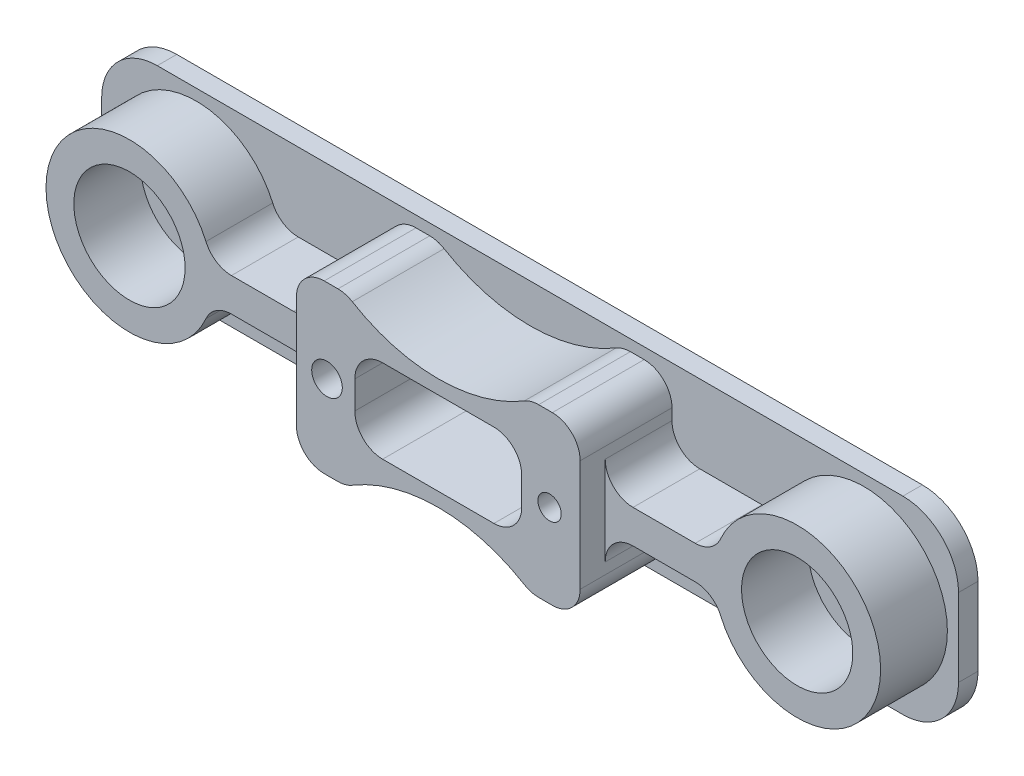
ISO-10303-21;
HEADER;
FILE_DESCRIPTION(('STEP AP214'),'2;1');
FILE_NAME('part.step','',(''),(''),'','','');
FILE_SCHEMA(('AUTOMOTIVE_DESIGN { 1 0 10303 214 1 1 1 1 }'));
ENDSEC;
DATA;
#1=APPLICATION_CONTEXT('core data for automotive mechanical design processes');
#2=APPLICATION_PROTOCOL_DEFINITION('international standard','automotive_design',2000,#1);
#3=PRODUCT_CONTEXT('',#1,'mechanical');
#4=PRODUCT('Part','Part','',(#3));
#5=PRODUCT_RELATED_PRODUCT_CATEGORY('part','',(#4));
#6=PRODUCT_DEFINITION_FORMATION('','',#4);
#7=PRODUCT_DEFINITION_CONTEXT('part definition',#1,'design');
#8=PRODUCT_DEFINITION('design','',#6,#7);
#9=PRODUCT_DEFINITION_SHAPE('','',#8);
#10=(LENGTH_UNIT() NAMED_UNIT(*) SI_UNIT(.MILLI.,.METRE.));
#11=(NAMED_UNIT(*) PLANE_ANGLE_UNIT() SI_UNIT($,.RADIAN.));
#12=(NAMED_UNIT(*) SI_UNIT($,.STERADIAN.) SOLID_ANGLE_UNIT());
#13=UNCERTAINTY_MEASURE_WITH_UNIT(LENGTH_MEASURE(1.E-05),#10,'distance_accuracy_value','');
#14=(GEOMETRIC_REPRESENTATION_CONTEXT(3) GLOBAL_UNCERTAINTY_ASSIGNED_CONTEXT((#13)) GLOBAL_UNIT_ASSIGNED_CONTEXT((#10,
#11,#12)) REPRESENTATION_CONTEXT('',''));
#15=CARTESIAN_POINT('',(0.,0.,0.));
#16=DIRECTION('',(0.,0.,1.));
#17=DIRECTION('',(1.,0.,0.));
#18=AXIS2_PLACEMENT_3D('',#15,#16,#17);
#19=CARTESIAN_POINT('',(67.,7.,20.));
#20=DIRECTION('',(0.,0.,-1.));
#21=DIRECTION('',(-1.,0.,0.));
#22=AXIS2_PLACEMENT_3D('',#19,#20,#21);
#23=PLANE('',#22);
#24=CARTESIAN_POINT('',(-20.,0.,20.));
#25=DIRECTION('',(0.,0.,-1.));
#26=DIRECTION('',(-1.,0.,0.));
#27=AXIS2_PLACEMENT_3D('',#24,#25,#26);
#28=CIRCLE('',#27,2.75);
#29=CARTESIAN_POINT('',(-22.75,0.,20.));
#30=VERTEX_POINT('',#29);
#31=EDGE_CURVE('E372',#30,#30,#28,.T.);
#32=ORIENTED_EDGE('',*,*,#31,.T.);
#33=EDGE_LOOP('',(#32));
#34=FACE_BOUND('',#33,.T.);
#35=DIRECTION('',(0.,-1.,0.));
#36=VECTOR('',#35,1.);
#37=CARTESIAN_POINT('',(25.5,-15.,20.));
#38=LINE('',#37,#36);
#39=CARTESIAN_POINT('',(25.5,10.,20.));
#40=VERTEX_POINT('',#39);
#41=CARTESIAN_POINT('',(25.5,-10.,20.));
#42=VERTEX_POINT('',#41);
#43=EDGE_CURVE('E414',#40,#42,#38,.T.);
#44=ORIENTED_EDGE('',*,*,#43,.F.);
#45=CARTESIAN_POINT('',(20.5,10.,20.));
#46=DIRECTION('',(0.,0.,-1.));
#47=DIRECTION('',(-1.,0.,0.));
#48=AXIS2_PLACEMENT_3D('',#45,#46,#47);
#49=CIRCLE('',#48,5.);
#50=CARTESIAN_POINT('',(20.5,15.,20.));
#51=VERTEX_POINT('',#50);
#52=EDGE_CURVE('E682',#40,#51,#49,.F.);
#53=ORIENTED_EDGE('',*,*,#52,.T.);
#54=DIRECTION('',(1.,0.,0.));
#55=VECTOR('',#54,1.);
#56=CARTESIAN_POINT('',(16.583123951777,15.,20.));
#57=LINE('',#56,#55);
#58=CARTESIAN_POINT('',(18.0277563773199,15.,20.));
#59=VERTEX_POINT('',#58);
#60=EDGE_CURVE('E410',#59,#51,#57,.T.);
#61=ORIENTED_EDGE('',*,*,#60,.F.);
#62=CARTESIAN_POINT('',(18.0277563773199,10.,20.));
#63=DIRECTION('',(0.,0.,-1.));
#64=DIRECTION('',(-1.,0.,0.));
#65=AXIS2_PLACEMENT_3D('',#62,#63,#64);
#66=CIRCLE('',#65,5.);
#67=CARTESIAN_POINT('',(15.4523626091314,14.2857142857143,20.));
#68=VERTEX_POINT('',#67);
#69=EDGE_CURVE('E679',#59,#68,#66,.F.);
#70=ORIENTED_EDGE('',*,*,#69,.T.);
#71=CARTESIAN_POINT('',(0.,40.,20.));
#72=DIRECTION('',(0.,0.,-1.));
#73=DIRECTION('',(-1.,0.,0.));
#74=AXIS2_PLACEMENT_3D('',#71,#72,#73);
#75=CIRCLE('',#74,30.);
#76=CARTESIAN_POINT('',(-15.4523626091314,14.2857142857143,20.));
#77=VERTEX_POINT('',#76);
#78=EDGE_CURVE('E405',#77,#68,#75,.F.);
#79=ORIENTED_EDGE('',*,*,#78,.F.);
#80=CARTESIAN_POINT('',(-18.0277563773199,10.,20.));
#81=DIRECTION('',(0.,0.,-1.));
#82=DIRECTION('',(-1.,0.,0.));
#83=AXIS2_PLACEMENT_3D('',#80,#81,#82);
#84=CIRCLE('',#83,5.);
#85=CARTESIAN_POINT('',(-18.0277563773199,15.,20.));
#86=VERTEX_POINT('',#85);
#87=EDGE_CURVE('E676',#77,#86,#84,.F.);
#88=ORIENTED_EDGE('',*,*,#87,.T.);
#89=DIRECTION('',(1.,0.,0.));
#90=VECTOR('',#89,1.);
#91=CARTESIAN_POINT('',(-25.5,15.,20.));
#92=LINE('',#91,#90);
#93=CARTESIAN_POINT('',(-20.5,15.,20.));
#94=VERTEX_POINT('',#93);
#95=EDGE_CURVE('E401',#94,#86,#92,.T.);
#96=ORIENTED_EDGE('',*,*,#95,.F.);
#97=CARTESIAN_POINT('',(-20.5,10.,20.));
#98=DIRECTION('',(0.,0.,-1.));
#99=DIRECTION('',(-1.,0.,0.));
#100=AXIS2_PLACEMENT_3D('',#97,#98,#99);
#101=CIRCLE('',#100,5.);
#102=CARTESIAN_POINT('',(-25.5,10.,20.));
#103=VERTEX_POINT('',#102);
#104=EDGE_CURVE('E673',#94,#103,#101,.F.);
#105=ORIENTED_EDGE('',*,*,#104,.T.);
#106=DIRECTION('',(0.,1.,0.));
#107=VECTOR('',#106,1.);
#108=CARTESIAN_POINT('',(-25.5,15.,20.));
#109=LINE('',#108,#107);
#110=CARTESIAN_POINT('',(-25.5,-10.,20.));
#111=VERTEX_POINT('',#110);
#112=EDGE_CURVE('E406',#111,#103,#109,.T.);
#113=ORIENTED_EDGE('',*,*,#112,.F.);
#114=CARTESIAN_POINT('',(-20.5,-10.,20.));
#115=DIRECTION('',(0.,0.,-1.));
#116=DIRECTION('',(-1.,0.,0.));
#117=AXIS2_PLACEMENT_3D('',#114,#115,#116);
#118=CIRCLE('',#117,5.);
#119=CARTESIAN_POINT('',(-20.5,-15.,20.));
#120=VERTEX_POINT('',#119);
#121=EDGE_CURVE('E661',#111,#120,#118,.F.);
#122=ORIENTED_EDGE('',*,*,#121,.T.);
#123=DIRECTION('',(-1.,0.,0.));
#124=VECTOR('',#123,1.);
#125=CARTESIAN_POINT('',(-25.5,-15.,20.));
#126=LINE('',#125,#124);
#127=CARTESIAN_POINT('',(-18.0277563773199,-15.,20.));
#128=VERTEX_POINT('',#127);
#129=EDGE_CURVE('E426',#128,#120,#126,.T.);
#130=ORIENTED_EDGE('',*,*,#129,.F.);
#131=CARTESIAN_POINT('',(-18.0277563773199,-10.,20.));
#132=DIRECTION('',(0.,0.,-1.));
#133=DIRECTION('',(-1.,0.,0.));
#134=AXIS2_PLACEMENT_3D('',#131,#132,#133);
#135=CIRCLE('',#134,5.);
#136=CARTESIAN_POINT('',(-15.4523626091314,-14.2857142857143,20.));
#137=VERTEX_POINT('',#136);
#138=EDGE_CURVE('E664',#128,#137,#135,.F.);
#139=ORIENTED_EDGE('',*,*,#138,.T.);
#140=CARTESIAN_POINT('',(0.,-40.,20.));
#141=DIRECTION('',(0.,0.,-1.));
#142=DIRECTION('',(-1.,0.,0.));
#143=AXIS2_PLACEMENT_3D('',#140,#141,#142);
#144=CIRCLE('',#143,30.);
#145=CARTESIAN_POINT('',(15.4523626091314,-14.2857142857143,20.));
#146=VERTEX_POINT('',#145);
#147=EDGE_CURVE('E422',#146,#137,#144,.F.);
#148=ORIENTED_EDGE('',*,*,#147,.F.);
#149=CARTESIAN_POINT('',(18.0277563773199,-10.,20.));
#150=DIRECTION('',(0.,0.,-1.));
#151=DIRECTION('',(-1.,0.,0.));
#152=AXIS2_PLACEMENT_3D('',#149,#150,#151);
#153=CIRCLE('',#152,5.);
#154=CARTESIAN_POINT('',(18.0277563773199,-15.,20.));
#155=VERTEX_POINT('',#154);
#156=EDGE_CURVE('E667',#146,#155,#153,.F.);
#157=ORIENTED_EDGE('',*,*,#156,.T.);
#158=DIRECTION('',(-1.,0.,0.));
#159=VECTOR('',#158,1.);
#160=CARTESIAN_POINT('',(16.583123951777,-15.,20.));
#161=LINE('',#160,#159);
#162=CARTESIAN_POINT('',(20.5,-15.,20.));
#163=VERTEX_POINT('',#162);
#164=EDGE_CURVE('E418',#163,#155,#161,.T.);
#165=ORIENTED_EDGE('',*,*,#164,.F.);
#166=CARTESIAN_POINT('',(20.5,-10.,20.));
#167=DIRECTION('',(0.,0.,-1.));
#168=DIRECTION('',(-1.,0.,0.));
#169=AXIS2_PLACEMENT_3D('',#166,#167,#168);
#170=CIRCLE('',#169,5.);
#171=EDGE_CURVE('E670',#163,#42,#170,.F.);
#172=ORIENTED_EDGE('',*,*,#171,.T.);
#173=EDGE_LOOP('',(#44,#53,#61,#70,#79,#88,#96,#105,#113,#122,#130,#139,#148,#157,#165,#172));
#174=FACE_BOUND('',#173,.T.);
#175=DIRECTION('',(-1.,0.,0.));
#176=VECTOR('',#175,1.);
#177=CARTESIAN_POINT('',(-15.,7.5,20.));
#178=LINE('',#177,#176);
#179=CARTESIAN_POINT('',(10.,7.5,20.));
#180=VERTEX_POINT('',#179);
#181=CARTESIAN_POINT('',(-10.,7.5,20.));
#182=VERTEX_POINT('',#181);
#183=EDGE_CURVE('E369',#180,#182,#178,.T.);
#184=ORIENTED_EDGE('',*,*,#183,.F.);
#185=CARTESIAN_POINT('',(10.,2.5,20.));
#186=DIRECTION('',(0.,0.,-1.));
#187=DIRECTION('',(-1.,0.,0.));
#188=AXIS2_PLACEMENT_3D('',#185,#186,#187);
#189=CIRCLE('',#188,5.);
#190=CARTESIAN_POINT('',(15.,2.5,20.));
#191=VERTEX_POINT('',#190);
#192=EDGE_CURVE('E749',#180,#191,#189,.T.);
#193=ORIENTED_EDGE('',*,*,#192,.T.);
#194=DIRECTION('',(0.,1.,0.));
#195=VECTOR('',#194,1.);
#196=CARTESIAN_POINT('',(15.,-7.5,20.));
#197=LINE('',#196,#195);
#198=CARTESIAN_POINT('',(15.,-2.5,20.));
#199=VERTEX_POINT('',#198);
#200=EDGE_CURVE('E362',#199,#191,#197,.T.);
#201=ORIENTED_EDGE('',*,*,#200,.F.);
#202=CARTESIAN_POINT('',(10.,-2.5,20.));
#203=DIRECTION('',(0.,0.,-1.));
#204=DIRECTION('',(-1.,0.,0.));
#205=AXIS2_PLACEMENT_3D('',#202,#203,#204);
#206=CIRCLE('',#205,5.);
#207=CARTESIAN_POINT('',(10.,-7.5,20.));
#208=VERTEX_POINT('',#207);
#209=EDGE_CURVE('E746',#199,#208,#206,.T.);
#210=ORIENTED_EDGE('',*,*,#209,.T.);
#211=DIRECTION('',(1.,0.,0.));
#212=VECTOR('',#211,1.);
#213=CARTESIAN_POINT('',(-15.,-7.5,20.));
#214=LINE('',#213,#212);
#215=CARTESIAN_POINT('',(-10.,-7.5,20.));
#216=VERTEX_POINT('',#215);
#217=EDGE_CURVE('E380',#216,#208,#214,.T.);
#218=ORIENTED_EDGE('',*,*,#217,.F.);
#219=CARTESIAN_POINT('',(-10.,-2.5,20.));
#220=DIRECTION('',(0.,0.,-1.));
#221=DIRECTION('',(-1.,0.,0.));
#222=AXIS2_PLACEMENT_3D('',#219,#220,#221);
#223=CIRCLE('',#222,5.);
#224=CARTESIAN_POINT('',(-15.,-2.5,20.));
#225=VERTEX_POINT('',#224);
#226=EDGE_CURVE('E743',#216,#225,#223,.T.);
#227=ORIENTED_EDGE('',*,*,#226,.T.);
#228=DIRECTION('',(0.,-1.,0.));
#229=VECTOR('',#228,1.);
#230=CARTESIAN_POINT('',(-15.,-7.5,20.));
#231=LINE('',#230,#229);
#232=CARTESIAN_POINT('',(-15.,2.5,20.));
#233=VERTEX_POINT('',#232);
#234=EDGE_CURVE('E394',#233,#225,#231,.T.);
#235=ORIENTED_EDGE('',*,*,#234,.F.);
#236=CARTESIAN_POINT('',(-10.,2.5,20.));
#237=DIRECTION('',(0.,0.,-1.));
#238=DIRECTION('',(-1.,0.,0.));
#239=AXIS2_PLACEMENT_3D('',#236,#237,#238);
#240=CIRCLE('',#239,5.);
#241=EDGE_CURVE('E740',#233,#182,#240,.T.);
#242=ORIENTED_EDGE('',*,*,#241,.T.);
#243=EDGE_LOOP('',(#184,#193,#201,#210,#218,#227,#235,#242));
#244=FACE_BOUND('',#243,.T.);
#245=CARTESIAN_POINT('',(20.,0.,20.));
#246=DIRECTION('',(0.,0.,1.));
#247=DIRECTION('',(1.,0.,0.));
#248=AXIS2_PLACEMENT_3D('',#245,#246,#247);
#249=CIRCLE('',#248,2.1);
#250=CARTESIAN_POINT('',(22.1,0.,20.));
#251=VERTEX_POINT('',#250);
#252=EDGE_CURVE('E363',#251,#251,#249,.T.);
#253=ORIENTED_EDGE('',*,*,#252,.F.);
#254=EDGE_LOOP('',(#253));
#255=FACE_BOUND('',#254,.T.);
#256=ADVANCED_FACE('F42',(#34,#174,#244,#255),#23,.F.);
#257=CARTESIAN_POINT('',(67.,7.,3.5));
#258=DIRECTION('',(0.,0.,-1.));
#259=DIRECTION('',(-1.,0.,0.));
#260=AXIS2_PLACEMENT_3D('',#257,#258,#259);
#261=PLANE('',#260);
#262=CARTESIAN_POINT('',(67.,7.,3.5));
#263=DIRECTION('',(0.,0.,1.));
#264=DIRECTION('',(-1.,0.,0.));
#265=AXIS2_PLACEMENT_3D('',#262,#263,#264);
#266=CIRCLE('',#265,10.);
#267=CARTESIAN_POINT('',(77.,6.99999999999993,3.5));
#268=VERTEX_POINT('',#267);
#269=CARTESIAN_POINT('',(66.9999999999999,17.,3.5));
#270=VERTEX_POINT('',#269);
#271=EDGE_CURVE('E515',#268,#270,#266,.T.);
#272=ORIENTED_EDGE('',*,*,#271,.T.);
#273=DIRECTION('',(-1.,0.,0.));
#274=VECTOR('',#273,1.);
#275=CARTESIAN_POINT('',(-66.9999999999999,17.,3.5));
#276=LINE('',#275,#274);
#277=CARTESIAN_POINT('',(-66.9999999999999,17.,3.5));
#278=VERTEX_POINT('',#277);
#279=EDGE_CURVE('E519',#270,#278,#276,.T.);
#280=ORIENTED_EDGE('',*,*,#279,.T.);
#281=CARTESIAN_POINT('',(-67.,7.,3.5));
#282=DIRECTION('',(0.,0.,1.));
#283=DIRECTION('',(-1.,0.,0.));
#284=AXIS2_PLACEMENT_3D('',#281,#282,#283);
#285=CIRCLE('',#284,10.);
#286=CARTESIAN_POINT('',(-77.,6.99999999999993,3.5));
#287=VERTEX_POINT('',#286);
#288=EDGE_CURVE('E523',#278,#287,#285,.T.);
#289=ORIENTED_EDGE('',*,*,#288,.T.);
#290=DIRECTION('',(0.,-1.,0.));
#291=VECTOR('',#290,1.);
#292=CARTESIAN_POINT('',(-77.,-6.99999999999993,3.5));
#293=LINE('',#292,#291);
#294=CARTESIAN_POINT('',(-77.,-6.99999999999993,3.5));
#295=VERTEX_POINT('',#294);
#296=EDGE_CURVE('E526',#287,#295,#293,.T.);
#297=ORIENTED_EDGE('',*,*,#296,.T.);
#298=CARTESIAN_POINT('',(-67.,-7.,3.5));
#299=DIRECTION('',(0.,0.,1.));
#300=DIRECTION('',(-1.,0.,0.));
#301=AXIS2_PLACEMENT_3D('',#298,#299,#300);
#302=CIRCLE('',#301,10.);
#303=CARTESIAN_POINT('',(-66.9999999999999,-17.,3.5));
#304=VERTEX_POINT('',#303);
#305=EDGE_CURVE('E529',#295,#304,#302,.T.);
#306=ORIENTED_EDGE('',*,*,#305,.T.);
#307=DIRECTION('',(1.,0.,0.));
#308=VECTOR('',#307,1.);
#309=CARTESIAN_POINT('',(-66.9999999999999,-17.,3.5));
#310=LINE('',#309,#308);
#311=CARTESIAN_POINT('',(66.9999999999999,-17.,3.5));
#312=VERTEX_POINT('',#311);
#313=EDGE_CURVE('E532',#304,#312,#310,.T.);
#314=ORIENTED_EDGE('',*,*,#313,.T.);
#315=CARTESIAN_POINT('',(67.,-7.,3.5));
#316=DIRECTION('',(0.,0.,1.));
#317=DIRECTION('',(1.,0.,0.));
#318=AXIS2_PLACEMENT_3D('',#315,#316,#317);
#319=CIRCLE('',#318,10.);
#320=CARTESIAN_POINT('',(77.,-6.99999999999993,3.5));
#321=VERTEX_POINT('',#320);
#322=EDGE_CURVE('E535',#312,#321,#319,.T.);
#323=ORIENTED_EDGE('',*,*,#322,.T.);
#324=DIRECTION('',(0.,1.,0.));
#325=VECTOR('',#324,1.);
#326=CARTESIAN_POINT('',(77.,-6.99999999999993,3.5));
#327=LINE('',#326,#325);
#328=EDGE_CURVE('E538',#321,#268,#327,.T.);
#329=ORIENTED_EDGE('',*,*,#328,.T.);
#330=EDGE_LOOP('',(#272,#280,#289,#297,#306,#314,#323,#329));
#331=FACE_BOUND('',#330,.T.);
#332=DIRECTION('',(-1.,0.,0.));
#333=VECTOR('',#332,1.);
#334=CARTESIAN_POINT('',(-45.3030615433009,3.,3.5));
#335=LINE('',#334,#333);
#336=CARTESIAN_POINT('',(41.6696972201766,3.,3.5));
#337=VERTEX_POINT('',#336);
#338=CARTESIAN_POINT('',(30.5,3.,3.5));
#339=VERTEX_POINT('',#338);
#340=EDGE_CURVE('E490',#337,#339,#335,.T.);
#341=ORIENTED_EDGE('',*,*,#340,.F.);
#342=CARTESIAN_POINT('',(41.6696972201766,8.,3.5));
#343=DIRECTION('',(0.,0.,-1.));
#344=DIRECTION('',(-1.,0.,0.));
#345=AXIS2_PLACEMENT_3D('',#342,#343,#344);
#346=CIRCLE('',#345,5.);
#347=CARTESIAN_POINT('',(46.2522729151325,6.,3.5));
#348=VERTEX_POINT('',#347);
#349=EDGE_CURVE('E637',#337,#348,#346,.F.);
#350=ORIENTED_EDGE('',*,*,#349,.T.);
#351=CARTESIAN_POINT('',(60.,0.,3.5));
#352=DIRECTION('',(0.,0.,1.));
#353=DIRECTION('',(-1.,0.,0.));
#354=AXIS2_PLACEMENT_3D('',#351,#352,#353);
#355=CIRCLE('',#354,15.);
#356=CARTESIAN_POINT('',(46.2522729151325,-6.,3.5));
#357=VERTEX_POINT('',#356);
#358=EDGE_CURVE('E507',#357,#348,#355,.T.);
#359=ORIENTED_EDGE('',*,*,#358,.F.);
#360=CARTESIAN_POINT('',(41.6696972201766,-8.,3.5));
#361=DIRECTION('',(0.,0.,-1.));
#362=DIRECTION('',(-1.,0.,0.));
#363=AXIS2_PLACEMENT_3D('',#360,#361,#362);
#364=CIRCLE('',#363,5.);
#365=CARTESIAN_POINT('',(41.6696972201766,-3.,3.5));
#366=VERTEX_POINT('',#365);
#367=EDGE_CURVE('E625',#357,#366,#364,.F.);
#368=ORIENTED_EDGE('',*,*,#367,.T.);
#369=DIRECTION('',(1.,0.,0.));
#370=VECTOR('',#369,1.);
#371=CARTESIAN_POINT('',(-45.3030615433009,-3.,3.5));
#372=LINE('',#371,#370);
#373=CARTESIAN_POINT('',(30.5,-3.,3.5));
#374=VERTEX_POINT('',#373);
#375=EDGE_CURVE('E503',#374,#366,#372,.T.);
#376=ORIENTED_EDGE('',*,*,#375,.F.);
#377=CARTESIAN_POINT('',(30.5,-8.,3.5));
#378=DIRECTION('',(0.,0.,-1.));
#379=DIRECTION('',(-1.,0.,0.));
#380=AXIS2_PLACEMENT_3D('',#377,#378,#379);
#381=CIRCLE('',#380,5.);
#382=CARTESIAN_POINT('',(25.5,-8.,3.5));
#383=VERTEX_POINT('',#382);
#384=EDGE_CURVE('E622',#374,#383,#381,.F.);
#385=ORIENTED_EDGE('',*,*,#384,.T.);
#386=DIRECTION('',(0.,1.,0.));
#387=VECTOR('',#386,1.);
#388=CARTESIAN_POINT('',(25.5,-15.,3.5));
#389=LINE('',#388,#387);
#390=CARTESIAN_POINT('',(25.5,-10.,3.5));
#391=VERTEX_POINT('',#390);
#392=EDGE_CURVE('E443',#391,#383,#389,.T.);
#393=ORIENTED_EDGE('',*,*,#392,.F.);
#394=CARTESIAN_POINT('',(20.5,-10.,3.5));
#395=DIRECTION('',(0.,0.,-1.));
#396=DIRECTION('',(-1.,0.,0.));
#397=AXIS2_PLACEMENT_3D('',#394,#395,#396);
#398=CIRCLE('',#397,5.);
#399=CARTESIAN_POINT('',(20.5,-15.,3.5));
#400=VERTEX_POINT('',#399);
#401=EDGE_CURVE('E777',#391,#400,#398,.T.);
#402=ORIENTED_EDGE('',*,*,#401,.T.);
#403=DIRECTION('',(1.,0.,0.));
#404=VECTOR('',#403,1.);
#405=CARTESIAN_POINT('',(16.583123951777,-15.,3.5));
#406=LINE('',#405,#404);
#407=CARTESIAN_POINT('',(18.0277563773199,-15.,3.5));
#408=VERTEX_POINT('',#407);
#409=EDGE_CURVE('E438',#408,#400,#406,.T.);
#410=ORIENTED_EDGE('',*,*,#409,.F.);
#411=CARTESIAN_POINT('',(18.0277563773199,-10.,3.5));
#412=DIRECTION('',(0.,0.,-1.));
#413=DIRECTION('',(-1.,0.,0.));
#414=AXIS2_PLACEMENT_3D('',#411,#412,#413);
#415=CIRCLE('',#414,5.);
#416=CARTESIAN_POINT('',(15.4523626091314,-14.2857142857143,3.5));
#417=VERTEX_POINT('',#416);
#418=EDGE_CURVE('E780',#408,#417,#415,.T.);
#419=ORIENTED_EDGE('',*,*,#418,.T.);
#420=CARTESIAN_POINT('',(0.,-40.,3.5));
#421=DIRECTION('',(0.,0.,-1.));
#422=DIRECTION('',(-1.,0.,0.));
#423=AXIS2_PLACEMENT_3D('',#420,#421,#422);
#424=CIRCLE('',#423,30.);
#425=CARTESIAN_POINT('',(-15.4523626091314,-14.2857142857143,3.5));
#426=VERTEX_POINT('',#425);
#427=EDGE_CURVE('E434',#426,#417,#424,.T.);
#428=ORIENTED_EDGE('',*,*,#427,.F.);
#429=CARTESIAN_POINT('',(-18.0277563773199,-10.,3.5));
#430=DIRECTION('',(0.,0.,-1.));
#431=DIRECTION('',(-1.,0.,0.));
#432=AXIS2_PLACEMENT_3D('',#429,#430,#431);
#433=CIRCLE('',#432,5.);
#434=CARTESIAN_POINT('',(-18.0277563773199,-15.,3.5));
#435=VERTEX_POINT('',#434);
#436=EDGE_CURVE('E783',#426,#435,#433,.T.);
#437=ORIENTED_EDGE('',*,*,#436,.T.);
#438=DIRECTION('',(1.,0.,0.));
#439=VECTOR('',#438,1.);
#440=CARTESIAN_POINT('',(-25.5,-15.,3.5));
#441=LINE('',#440,#439);
#442=CARTESIAN_POINT('',(-20.5,-15.,3.5));
#443=VERTEX_POINT('',#442);
#444=EDGE_CURVE('E389',#443,#435,#441,.T.);
#445=ORIENTED_EDGE('',*,*,#444,.F.);
#446=CARTESIAN_POINT('',(-20.5,-10.,3.5));
#447=DIRECTION('',(0.,0.,-1.));
#448=DIRECTION('',(-1.,0.,0.));
#449=AXIS2_PLACEMENT_3D('',#446,#447,#448);
#450=CIRCLE('',#449,5.);
#451=CARTESIAN_POINT('',(-25.5,-10.,3.5));
#452=VERTEX_POINT('',#451);
#453=EDGE_CURVE('E786',#443,#452,#450,.T.);
#454=ORIENTED_EDGE('',*,*,#453,.T.);
#455=DIRECTION('',(0.,-1.,0.));
#456=VECTOR('',#455,1.);
#457=CARTESIAN_POINT('',(-25.5,15.,3.5));
#458=LINE('',#457,#456);
#459=CARTESIAN_POINT('',(-25.5,-8.,3.5));
#460=VERTEX_POINT('',#459);
#461=EDGE_CURVE('E459',#460,#452,#458,.T.);
#462=ORIENTED_EDGE('',*,*,#461,.F.);
#463=CARTESIAN_POINT('',(-30.5,-8.,3.5));
#464=DIRECTION('',(0.,0.,-1.));
#465=DIRECTION('',(-1.,0.,0.));
#466=AXIS2_PLACEMENT_3D('',#463,#464,#465);
#467=CIRCLE('',#466,5.);
#468=CARTESIAN_POINT('',(-30.5,-3.,3.5));
#469=VERTEX_POINT('',#468);
#470=EDGE_CURVE('E619',#460,#469,#467,.F.);
#471=ORIENTED_EDGE('',*,*,#470,.T.);
#472=CARTESIAN_POINT('',(-41.6696972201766,-3.,3.5));
#473=VERTEX_POINT('',#472);
#474=EDGE_CURVE('E504',#473,#469,#372,.T.);
#475=ORIENTED_EDGE('',*,*,#474,.F.);
#476=CARTESIAN_POINT('',(-41.6696972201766,-8.,3.5));
#477=DIRECTION('',(0.,0.,-1.));
#478=DIRECTION('',(-1.,0.,0.));
#479=AXIS2_PLACEMENT_3D('',#476,#477,#478);
#480=CIRCLE('',#479,5.);
#481=CARTESIAN_POINT('',(-46.2522729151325,-6.,3.5));
#482=VERTEX_POINT('',#481);
#483=EDGE_CURVE('E616',#473,#482,#480,.F.);
#484=ORIENTED_EDGE('',*,*,#483,.T.);
#485=CARTESIAN_POINT('',(-60.,0.,3.5));
#486=DIRECTION('',(0.,0.,1.));
#487=DIRECTION('',(1.,0.,0.));
#488=AXIS2_PLACEMENT_3D('',#485,#486,#487);
#489=CIRCLE('',#488,15.);
#490=CARTESIAN_POINT('',(-46.2522729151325,6.,3.5));
#491=VERTEX_POINT('',#490);
#492=EDGE_CURVE('E484',#491,#482,#489,.T.);
#493=ORIENTED_EDGE('',*,*,#492,.F.);
#494=CARTESIAN_POINT('',(-41.6696972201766,8.,3.5));
#495=DIRECTION('',(0.,0.,-1.));
#496=DIRECTION('',(-1.,0.,0.));
#497=AXIS2_PLACEMENT_3D('',#494,#495,#496);
#498=CIRCLE('',#497,5.);
#499=CARTESIAN_POINT('',(-41.6696972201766,3.,3.5));
#500=VERTEX_POINT('',#499);
#501=EDGE_CURVE('E628',#491,#500,#498,.F.);
#502=ORIENTED_EDGE('',*,*,#501,.T.);
#503=CARTESIAN_POINT('',(-30.5,3.,3.5));
#504=VERTEX_POINT('',#503);
#505=EDGE_CURVE('E511',#504,#500,#335,.T.);
#506=ORIENTED_EDGE('',*,*,#505,.F.);
#507=CARTESIAN_POINT('',(-30.5,8.,3.5));
#508=DIRECTION('',(0.,0.,-1.));
#509=DIRECTION('',(-1.,0.,0.));
#510=AXIS2_PLACEMENT_3D('',#507,#508,#509);
#511=CIRCLE('',#510,5.);
#512=CARTESIAN_POINT('',(-25.5,8.,3.5));
#513=VERTEX_POINT('',#512);
#514=EDGE_CURVE('E631',#504,#513,#511,.F.);
#515=ORIENTED_EDGE('',*,*,#514,.T.);
#516=CARTESIAN_POINT('',(-25.5,10.,3.5));
#517=VERTEX_POINT('',#516);
#518=EDGE_CURVE('E463',#517,#513,#458,.T.);
#519=ORIENTED_EDGE('',*,*,#518,.F.);
#520=CARTESIAN_POINT('',(-20.5,10.,3.5));
#521=DIRECTION('',(0.,0.,-1.));
#522=DIRECTION('',(-1.,0.,0.));
#523=AXIS2_PLACEMENT_3D('',#520,#521,#522);
#524=CIRCLE('',#523,5.);
#525=CARTESIAN_POINT('',(-20.5,15.,3.5));
#526=VERTEX_POINT('',#525);
#527=EDGE_CURVE('E766',#517,#526,#524,.T.);
#528=ORIENTED_EDGE('',*,*,#527,.T.);
#529=DIRECTION('',(-1.,0.,0.));
#530=VECTOR('',#529,1.);
#531=CARTESIAN_POINT('',(-25.5,15.,3.5));
#532=LINE('',#531,#530);
#533=CARTESIAN_POINT('',(-18.0277563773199,15.,3.5));
#534=VERTEX_POINT('',#533);
#535=EDGE_CURVE('E455',#534,#526,#532,.T.);
#536=ORIENTED_EDGE('',*,*,#535,.F.);
#537=CARTESIAN_POINT('',(-18.0277563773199,10.,3.5));
#538=DIRECTION('',(0.,0.,-1.));
#539=DIRECTION('',(-1.,0.,0.));
#540=AXIS2_PLACEMENT_3D('',#537,#538,#539);
#541=CIRCLE('',#540,5.);
#542=CARTESIAN_POINT('',(-15.4523626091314,14.2857142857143,3.5));
#543=VERTEX_POINT('',#542);
#544=EDGE_CURVE('E763',#534,#543,#541,.T.);
#545=ORIENTED_EDGE('',*,*,#544,.T.);
#546=CARTESIAN_POINT('',(0.,40.,3.5));
#547=DIRECTION('',(0.,0.,-1.));
#548=DIRECTION('',(1.,0.,0.));
#549=AXIS2_PLACEMENT_3D('',#546,#547,#548);
#550=CIRCLE('',#549,30.);
#551=CARTESIAN_POINT('',(15.4523626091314,14.2857142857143,3.5));
#552=VERTEX_POINT('',#551);
#553=EDGE_CURVE('E451',#552,#543,#550,.T.);
#554=ORIENTED_EDGE('',*,*,#553,.F.);
#555=CARTESIAN_POINT('',(18.0277563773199,10.,3.5));
#556=DIRECTION('',(0.,0.,-1.));
#557=DIRECTION('',(-1.,0.,0.));
#558=AXIS2_PLACEMENT_3D('',#555,#556,#557);
#559=CIRCLE('',#558,5.);
#560=CARTESIAN_POINT('',(18.0277563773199,15.,3.5));
#561=VERTEX_POINT('',#560);
#562=EDGE_CURVE('E760',#552,#561,#559,.T.);
#563=ORIENTED_EDGE('',*,*,#562,.T.);
#564=DIRECTION('',(-1.,0.,0.));
#565=VECTOR('',#564,1.);
#566=CARTESIAN_POINT('',(16.583123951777,15.,3.5));
#567=LINE('',#566,#565);
#568=CARTESIAN_POINT('',(20.5,15.,3.5));
#569=VERTEX_POINT('',#568);
#570=EDGE_CURVE('E447',#569,#561,#567,.T.);
#571=ORIENTED_EDGE('',*,*,#570,.F.);
#572=CARTESIAN_POINT('',(20.5,10.,3.5));
#573=DIRECTION('',(0.,0.,-1.));
#574=DIRECTION('',(-1.,0.,0.));
#575=AXIS2_PLACEMENT_3D('',#572,#573,#574);
#576=CIRCLE('',#575,5.);
#577=CARTESIAN_POINT('',(25.5,10.,3.5));
#578=VERTEX_POINT('',#577);
#579=EDGE_CURVE('E757',#569,#578,#576,.T.);
#580=ORIENTED_EDGE('',*,*,#579,.T.);
#581=CARTESIAN_POINT('',(25.5,8.,3.5));
#582=VERTEX_POINT('',#581);
#583=EDGE_CURVE('E442',#582,#578,#389,.T.);
#584=ORIENTED_EDGE('',*,*,#583,.F.);
#585=CARTESIAN_POINT('',(30.5,8.,3.5));
#586=DIRECTION('',(0.,0.,-1.));
#587=DIRECTION('',(-1.,0.,0.));
#588=AXIS2_PLACEMENT_3D('',#585,#586,#587);
#589=CIRCLE('',#588,5.);
#590=EDGE_CURVE('E634',#582,#339,#589,.F.);
#591=ORIENTED_EDGE('',*,*,#590,.T.);
#592=EDGE_LOOP('',(#341,#350,#359,#368,#376,#385,#393,#402,#410,#419,#428,#437,#445,#454,#462,
#471,#475,#484,#493,#502,#506,#515,#519,#528,#536,#545,#554,#563,#571,#580,#584,#591));
#593=FACE_BOUND('',#592,.T.);
#594=ADVANCED_FACE('F802',(#331,#593),#261,.F.);
#595=CARTESIAN_POINT('',(-60.,0.,15.5));
#596=DIRECTION('',(0.,0.,1.));
#597=DIRECTION('',(1.,0.,0.));
#598=AXIS2_PLACEMENT_3D('',#595,#596,#597);
#599=PLANE('',#598);
#600=CARTESIAN_POINT('',(-60.,0.,15.5));
#601=DIRECTION('',(0.,0.,1.));
#602=DIRECTION('',(1.,0.,0.));
#603=AXIS2_PLACEMENT_3D('',#600,#601,#602);
#604=CIRCLE('',#603,10.);
#605=CARTESIAN_POINT('',(-50.,0.,15.5));
#606=VERTEX_POINT('',#605);
#607=EDGE_CURVE('E480',#606,#606,#604,.T.);
#608=ORIENTED_EDGE('',*,*,#607,.F.);
#609=EDGE_LOOP('',(#608));
#610=FACE_BOUND('',#609,.T.);
#611=CARTESIAN_POINT('',(-60.,0.,15.5));
#612=DIRECTION('',(0.,0.,1.));
#613=DIRECTION('',(1.,0.,0.));
#614=AXIS2_PLACEMENT_3D('',#611,#612,#613);
#615=CIRCLE('',#614,15.);
#616=CARTESIAN_POINT('',(-46.2522729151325,6.,15.5));
#617=VERTEX_POINT('',#616);
#618=CARTESIAN_POINT('',(-46.2522729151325,-6.,15.5));
#619=VERTEX_POINT('',#618);
#620=EDGE_CURVE('E487',#617,#619,#615,.T.);
#621=ORIENTED_EDGE('',*,*,#620,.T.);
#622=CARTESIAN_POINT('',(-41.6696972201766,-8.,15.5));
#623=DIRECTION('',(0.,0.,1.));
#624=DIRECTION('',(1.,0.,0.));
#625=AXIS2_PLACEMENT_3D('',#622,#623,#624);
#626=CIRCLE('',#625,5.);
#627=CARTESIAN_POINT('',(-41.6696972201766,-3.,15.5));
#628=VERTEX_POINT('',#627);
#629=EDGE_CURVE('E12',#619,#628,#626,.F.);
#630=ORIENTED_EDGE('',*,*,#629,.T.);
#631=DIRECTION('',(1.,0.,0.));
#632=VECTOR('',#631,1.);
#633=CARTESIAN_POINT('',(-45.3030615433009,-3.,15.5));
#634=LINE('',#633,#632);
#635=CARTESIAN_POINT('',(-30.5,-3.,15.5));
#636=VERTEX_POINT('',#635);
#637=EDGE_CURVE('E491',#628,#636,#634,.T.);
#638=ORIENTED_EDGE('',*,*,#637,.T.);
#639=CARTESIAN_POINT('',(-30.5,-8.,15.5));
#640=DIRECTION('',(0.,0.,1.));
#641=DIRECTION('',(1.,0.,0.));
#642=AXIS2_PLACEMENT_3D('',#639,#640,#641);
#643=CIRCLE('',#642,5.);
#644=CARTESIAN_POINT('',(-25.5,-8.,15.5));
#645=VERTEX_POINT('',#644);
#646=EDGE_CURVE('E50',#636,#645,#643,.F.);
#647=ORIENTED_EDGE('',*,*,#646,.T.);
#648=DIRECTION('',(0.,1.,0.));
#649=VECTOR('',#648,1.);
#650=CARTESIAN_POINT('',(-25.5,0.,15.5));
#651=LINE('',#650,#649);
#652=CARTESIAN_POINT('',(-25.5,8.,15.5));
#653=VERTEX_POINT('',#652);
#654=EDGE_CURVE('E469',#645,#653,#651,.T.);
#655=ORIENTED_EDGE('',*,*,#654,.T.);
#656=CARTESIAN_POINT('',(-30.5,8.,15.5));
#657=DIRECTION('',(0.,0.,1.));
#658=DIRECTION('',(1.,0.,0.));
#659=AXIS2_PLACEMENT_3D('',#656,#657,#658);
#660=CIRCLE('',#659,5.);
#661=CARTESIAN_POINT('',(-30.5,3.,15.5));
#662=VERTEX_POINT('',#661);
#663=EDGE_CURVE('E769',#653,#662,#660,.F.);
#664=ORIENTED_EDGE('',*,*,#663,.T.);
#665=DIRECTION('',(-1.,0.,0.));
#666=VECTOR('',#665,1.);
#667=CARTESIAN_POINT('',(-45.3030615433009,3.,15.5));
#668=LINE('',#667,#666);
#669=CARTESIAN_POINT('',(-41.6696972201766,3.,15.5));
#670=VERTEX_POINT('',#669);
#671=EDGE_CURVE('E496',#662,#670,#668,.T.);
#672=ORIENTED_EDGE('',*,*,#671,.T.);
#673=CARTESIAN_POINT('',(-41.6696972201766,8.,15.5));
#674=DIRECTION('',(0.,0.,1.));
#675=DIRECTION('',(1.,0.,0.));
#676=AXIS2_PLACEMENT_3D('',#673,#674,#675);
#677=CIRCLE('',#676,5.);
#678=EDGE_CURVE('E771',#670,#617,#677,.F.);
#679=ORIENTED_EDGE('',*,*,#678,.T.);
#680=EDGE_LOOP('',(#621,#630,#638,#647,#655,#664,#672,#679));
#681=FACE_BOUND('',#680,.T.);
#682=ADVANCED_FACE('F791',(#610,#681),#599,.T.);
#683=CARTESIAN_POINT('',(60.,0.,15.5));
#684=DIRECTION('',(0.,0.,1.));
#685=DIRECTION('',(-1.,0.,0.));
#686=AXIS2_PLACEMENT_3D('',#683,#684,#685);
#687=CIRCLE('',#686,10.);
#688=CARTESIAN_POINT('',(50.,0.,15.5));
#689=VERTEX_POINT('',#688);
#690=EDGE_CURVE('E473',#689,#689,#687,.T.);
#691=ORIENTED_EDGE('',*,*,#690,.F.);
#692=EDGE_LOOP('',(#691));
#693=FACE_BOUND('',#692,.T.);
#694=CARTESIAN_POINT('',(60.,0.,15.5));
#695=DIRECTION('',(0.,0.,1.));
#696=DIRECTION('',(-1.,0.,0.));
#697=AXIS2_PLACEMENT_3D('',#694,#695,#696);
#698=CIRCLE('',#697,15.);
#699=CARTESIAN_POINT('',(46.2522729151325,-6.,15.5));
#700=VERTEX_POINT('',#699);
#701=CARTESIAN_POINT('',(46.2522729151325,6.,15.5));
#702=VERTEX_POINT('',#701);
#703=EDGE_CURVE('E493',#700,#702,#698,.T.);
#704=ORIENTED_EDGE('',*,*,#703,.T.);
#705=CARTESIAN_POINT('',(41.6696972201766,8.,15.5));
#706=DIRECTION('',(0.,0.,1.));
#707=DIRECTION('',(1.,0.,0.));
#708=AXIS2_PLACEMENT_3D('',#705,#706,#707);
#709=CIRCLE('',#708,5.);
#710=CARTESIAN_POINT('',(41.6696972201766,3.,15.5));
#711=VERTEX_POINT('',#710);
#712=EDGE_CURVE('E752',#702,#711,#709,.F.);
#713=ORIENTED_EDGE('',*,*,#712,.T.);
#714=CARTESIAN_POINT('',(30.5,3.,15.5));
#715=VERTEX_POINT('',#714);
#716=EDGE_CURVE('E499',#711,#715,#668,.T.);
#717=ORIENTED_EDGE('',*,*,#716,.T.);
#718=CARTESIAN_POINT('',(30.5,8.,15.5));
#719=DIRECTION('',(0.,0.,1.));
#720=DIRECTION('',(1.,0.,0.));
#721=AXIS2_PLACEMENT_3D('',#718,#719,#720);
#722=CIRCLE('',#721,5.);
#723=CARTESIAN_POINT('',(25.5,8.,15.5));
#724=VERTEX_POINT('',#723);
#725=EDGE_CURVE('E754',#715,#724,#722,.F.);
#726=ORIENTED_EDGE('',*,*,#725,.T.);
#727=DIRECTION('',(0.,-1.,0.));
#728=VECTOR('',#727,1.);
#729=CARTESIAN_POINT('',(25.5,0.,15.5));
#730=LINE('',#729,#728);
#731=CARTESIAN_POINT('',(25.5,-8.,15.5));
#732=VERTEX_POINT('',#731);
#733=EDGE_CURVE('E430',#724,#732,#730,.T.);
#734=ORIENTED_EDGE('',*,*,#733,.T.);
#735=CARTESIAN_POINT('',(30.5,-8.,15.5));
#736=DIRECTION('',(0.,0.,1.));
#737=DIRECTION('',(1.,0.,0.));
#738=AXIS2_PLACEMENT_3D('',#735,#736,#737);
#739=CIRCLE('',#738,5.);
#740=CARTESIAN_POINT('',(30.5,-3.,15.5));
#741=VERTEX_POINT('',#740);
#742=EDGE_CURVE('E775',#732,#741,#739,.F.);
#743=ORIENTED_EDGE('',*,*,#742,.T.);
#744=CARTESIAN_POINT('',(41.6696972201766,-3.,15.5));
#745=VERTEX_POINT('',#744);
#746=EDGE_CURVE('E489',#741,#745,#634,.T.);
#747=ORIENTED_EDGE('',*,*,#746,.T.);
#748=CARTESIAN_POINT('',(41.6696972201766,-8.,15.5));
#749=DIRECTION('',(0.,0.,1.));
#750=DIRECTION('',(1.,0.,0.));
#751=AXIS2_PLACEMENT_3D('',#748,#749,#750);
#752=CIRCLE('',#751,5.);
#753=EDGE_CURVE('E773',#745,#700,#752,.F.);
#754=ORIENTED_EDGE('',*,*,#753,.T.);
#755=EDGE_LOOP('',(#704,#713,#717,#726,#734,#743,#747,#754));
#756=FACE_BOUND('',#755,.T.);
#757=ADVANCED_FACE('F858',(#693,#756),#599,.T.);
#758=CARTESIAN_POINT('',(-45.3030615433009,-3.,15.5));
#759=DIRECTION('',(0.,1.,0.));
#760=DIRECTION('',(0.,0.,1.));
#761=AXIS2_PLACEMENT_3D('',#758,#759,#760);
#762=PLANE('',#761);
#763=ORIENTED_EDGE('',*,*,#474,.T.);
#764=DIRECTION('',(0.,0.,-1.));
#765=VECTOR('',#764,1.);
#766=CARTESIAN_POINT('',(-30.5,-3.,15.5));
#767=LINE('',#766,#765);
#768=EDGE_CURVE('E57',#469,#636,#767,.F.);
#769=ORIENTED_EDGE('',*,*,#768,.T.);
#770=ORIENTED_EDGE('',*,*,#637,.F.);
#771=DIRECTION('',(0.,0.,1.));
#772=VECTOR('',#771,1.);
#773=CARTESIAN_POINT('',(-41.6696972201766,-3.,3.5));
#774=LINE('',#773,#772);
#775=EDGE_CURVE('E736',#628,#473,#774,.F.);
#776=ORIENTED_EDGE('',*,*,#775,.T.);
#777=EDGE_LOOP('',(#763,#769,#770,#776));
#778=FACE_BOUND('',#777,.T.);
#779=ADVANCED_FACE('F1090',(#778),#762,.F.);
#780=ORIENTED_EDGE('',*,*,#375,.T.);
#781=DIRECTION('',(0.,0.,1.));
#782=VECTOR('',#781,1.);
#783=CARTESIAN_POINT('',(41.6696972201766,-3.,15.5));
#784=LINE('',#783,#782);
#785=EDGE_CURVE('E717',#366,#745,#784,.T.);
#786=ORIENTED_EDGE('',*,*,#785,.T.);
#787=ORIENTED_EDGE('',*,*,#746,.F.);
#788=DIRECTION('',(0.,0.,1.));
#789=VECTOR('',#788,1.);
#790=CARTESIAN_POINT('',(30.5,-3.,3.5));
#791=LINE('',#790,#789);
#792=EDGE_CURVE('E715',#741,#374,#791,.F.);
#793=ORIENTED_EDGE('',*,*,#792,.T.);
#794=EDGE_LOOP('',(#780,#786,#787,#793));
#795=FACE_BOUND('',#794,.T.);
#796=ADVANCED_FACE('F1085',(#795),#762,.F.);
#797=CARTESIAN_POINT('',(-45.3030615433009,3.,15.5));
#798=DIRECTION('',(0.,-1.,0.));
#799=DIRECTION('',(0.,0.,-1.));
#800=AXIS2_PLACEMENT_3D('',#797,#798,#799);
#801=PLANE('',#800);
#802=ORIENTED_EDGE('',*,*,#671,.F.);
#803=DIRECTION('',(0.,0.,1.));
#804=VECTOR('',#803,1.);
#805=CARTESIAN_POINT('',(-30.5,3.,3.5));
#806=LINE('',#805,#804);
#807=EDGE_CURVE('E708',#662,#504,#806,.F.);
#808=ORIENTED_EDGE('',*,*,#807,.T.);
#809=ORIENTED_EDGE('',*,*,#505,.T.);
#810=DIRECTION('',(0.,0.,1.));
#811=VECTOR('',#810,1.);
#812=CARTESIAN_POINT('',(-41.6696972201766,3.,15.5));
#813=LINE('',#812,#811);
#814=EDGE_CURVE('E706',#500,#670,#813,.T.);
#815=ORIENTED_EDGE('',*,*,#814,.T.);
#816=EDGE_LOOP('',(#802,#808,#809,#815));
#817=FACE_BOUND('',#816,.T.);
#818=ADVANCED_FACE('F1082',(#817),#801,.F.);
#819=ORIENTED_EDGE('',*,*,#716,.F.);
#820=DIRECTION('',(0.,0.,1.));
#821=VECTOR('',#820,1.);
#822=CARTESIAN_POINT('',(41.6696972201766,3.,3.5));
#823=LINE('',#822,#821);
#824=EDGE_CURVE('E613',#711,#337,#823,.F.);
#825=ORIENTED_EDGE('',*,*,#824,.T.);
#826=ORIENTED_EDGE('',*,*,#340,.T.);
#827=DIRECTION('',(0.,0.,-1.));
#828=VECTOR('',#827,1.);
#829=CARTESIAN_POINT('',(30.5,3.,15.5));
#830=LINE('',#829,#828);
#831=EDGE_CURVE('E611',#339,#715,#830,.F.);
#832=ORIENTED_EDGE('',*,*,#831,.T.);
#833=EDGE_LOOP('',(#819,#825,#826,#832));
#834=FACE_BOUND('',#833,.T.);
#835=ADVANCED_FACE('F865',(#834),#801,.F.);
#836=CARTESIAN_POINT('',(67.,7.,3.5));
#837=DIRECTION('',(0.,0.,-1.));
#838=DIRECTION('',(-1.,0.,0.));
#839=AXIS2_PLACEMENT_3D('',#836,#837,#838);
#840=CYLINDRICAL_SURFACE('',#839,10.);
#841=CARTESIAN_POINT('',(67.,7.,0.));
#842=DIRECTION('',(0.,0.,1.));
#843=DIRECTION('',(-1.,0.,0.));
#844=AXIS2_PLACEMENT_3D('',#841,#842,#843);
#845=CIRCLE('',#844,10.);
#846=CARTESIAN_POINT('',(77.,6.99999999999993,0.));
#847=VERTEX_POINT('',#846);
#848=CARTESIAN_POINT('',(66.9999999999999,17.,0.));
#849=VERTEX_POINT('',#848);
#850=EDGE_CURVE('E542',#847,#849,#845,.T.);
#851=ORIENTED_EDGE('',*,*,#850,.T.);
#852=DIRECTION('',(0.,0.,-1.));
#853=VECTOR('',#852,1.);
#854=CARTESIAN_POINT('',(66.9999999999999,17.,3.5));
#855=LINE('',#854,#853);
#856=EDGE_CURVE('E578',#270,#849,#855,.T.);
#857=ORIENTED_EDGE('',*,*,#856,.F.);
#858=ORIENTED_EDGE('',*,*,#271,.F.);
#859=DIRECTION('',(0.,0.,-1.));
#860=VECTOR('',#859,1.);
#861=CARTESIAN_POINT('',(77.,6.99999999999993,3.5));
#862=LINE('',#861,#860);
#863=EDGE_CURVE('E541',#268,#847,#862,.T.);
#864=ORIENTED_EDGE('',*,*,#863,.T.);
#865=EDGE_LOOP('',(#851,#857,#858,#864));
#866=FACE_BOUND('',#865,.T.);
#867=ADVANCED_FACE('F999',(#866),#840,.T.);
#868=CARTESIAN_POINT('',(-66.9999999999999,17.,3.5));
#869=DIRECTION('',(0.,-1.,0.));
#870=DIRECTION('',(0.,0.,-1.));
#871=AXIS2_PLACEMENT_3D('',#868,#869,#870);
#872=PLANE('',#871);
#873=DIRECTION('',(-1.,0.,0.));
#874=VECTOR('',#873,1.);
#875=CARTESIAN_POINT('',(-66.9999999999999,17.,0.));
#876=LINE('',#875,#874);
#877=CARTESIAN_POINT('',(-66.9999999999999,17.,0.));
#878=VERTEX_POINT('',#877);
#879=EDGE_CURVE('E545',#849,#878,#876,.T.);
#880=ORIENTED_EDGE('',*,*,#879,.T.);
#881=DIRECTION('',(0.,0.,-1.));
#882=VECTOR('',#881,1.);
#883=CARTESIAN_POINT('',(-66.9999999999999,17.,3.5));
#884=LINE('',#883,#882);
#885=EDGE_CURVE('E575',#278,#878,#884,.T.);
#886=ORIENTED_EDGE('',*,*,#885,.F.);
#887=ORIENTED_EDGE('',*,*,#279,.F.);
#888=ORIENTED_EDGE('',*,*,#856,.T.);
#889=EDGE_LOOP('',(#880,#886,#887,#888));
#890=FACE_BOUND('',#889,.T.);
#891=ADVANCED_FACE('F1027',(#890),#872,.F.);
#892=CARTESIAN_POINT('',(-67.,7.,3.5));
#893=DIRECTION('',(0.,0.,-1.));
#894=DIRECTION('',(-1.,0.,0.));
#895=AXIS2_PLACEMENT_3D('',#892,#893,#894);
#896=CYLINDRICAL_SURFACE('',#895,10.);
#897=CARTESIAN_POINT('',(-67.,7.,0.));
#898=DIRECTION('',(0.,0.,1.));
#899=DIRECTION('',(-1.,0.,0.));
#900=AXIS2_PLACEMENT_3D('',#897,#898,#899);
#901=CIRCLE('',#900,10.);
#902=CARTESIAN_POINT('',(-77.,6.99999999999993,0.));
#903=VERTEX_POINT('',#902);
#904=EDGE_CURVE('E547',#878,#903,#901,.T.);
#905=ORIENTED_EDGE('',*,*,#904,.T.);
#906=DIRECTION('',(0.,0.,-1.));
#907=VECTOR('',#906,1.);
#908=CARTESIAN_POINT('',(-77.,6.99999999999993,3.5));
#909=LINE('',#908,#907);
#910=EDGE_CURVE('E572',#287,#903,#909,.T.);
#911=ORIENTED_EDGE('',*,*,#910,.F.);
#912=ORIENTED_EDGE('',*,*,#288,.F.);
#913=ORIENTED_EDGE('',*,*,#885,.T.);
#914=EDGE_LOOP('',(#905,#911,#912,#913));
#915=FACE_BOUND('',#914,.T.);
#916=ADVANCED_FACE('F1023',(#915),#896,.T.);
#917=CARTESIAN_POINT('',(-77.,-6.99999999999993,3.5));
#918=DIRECTION('',(1.,0.,0.));
#919=DIRECTION('',(0.,0.,-1.));
#920=AXIS2_PLACEMENT_3D('',#917,#918,#919);
#921=PLANE('',#920);
#922=DIRECTION('',(0.,-1.,0.));
#923=VECTOR('',#922,1.);
#924=CARTESIAN_POINT('',(-77.,-6.99999999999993,0.));
#925=LINE('',#924,#923);
#926=CARTESIAN_POINT('',(-77.,-6.99999999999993,0.));
#927=VERTEX_POINT('',#926);
#928=EDGE_CURVE('E549',#903,#927,#925,.T.);
#929=ORIENTED_EDGE('',*,*,#928,.T.);
#930=DIRECTION('',(0.,0.,-1.));
#931=VECTOR('',#930,1.);
#932=CARTESIAN_POINT('',(-77.,-6.99999999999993,3.5));
#933=LINE('',#932,#931);
#934=EDGE_CURVE('E569',#295,#927,#933,.T.);
#935=ORIENTED_EDGE('',*,*,#934,.F.);
#936=ORIENTED_EDGE('',*,*,#296,.F.);
#937=ORIENTED_EDGE('',*,*,#910,.T.);
#938=EDGE_LOOP('',(#929,#935,#936,#937));
#939=FACE_BOUND('',#938,.T.);
#940=ADVANCED_FACE('F1020',(#939),#921,.F.);
#941=CARTESIAN_POINT('',(-67.,-7.,3.5));
#942=DIRECTION('',(0.,0.,-1.));
#943=DIRECTION('',(-1.,0.,0.));
#944=AXIS2_PLACEMENT_3D('',#941,#942,#943);
#945=CYLINDRICAL_SURFACE('',#944,10.);
#946=CARTESIAN_POINT('',(-67.,-7.,0.));
#947=DIRECTION('',(0.,0.,1.));
#948=DIRECTION('',(-1.,0.,0.));
#949=AXIS2_PLACEMENT_3D('',#946,#947,#948);
#950=CIRCLE('',#949,10.);
#951=CARTESIAN_POINT('',(-66.9999999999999,-17.,0.));
#952=VERTEX_POINT('',#951);
#953=EDGE_CURVE('E551',#927,#952,#950,.T.);
#954=ORIENTED_EDGE('',*,*,#953,.T.);
#955=DIRECTION('',(0.,0.,-1.));
#956=VECTOR('',#955,1.);
#957=CARTESIAN_POINT('',(-66.9999999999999,-17.,3.5));
#958=LINE('',#957,#956);
#959=EDGE_CURVE('E566',#304,#952,#958,.T.);
#960=ORIENTED_EDGE('',*,*,#959,.F.);
#961=ORIENTED_EDGE('',*,*,#305,.F.);
#962=ORIENTED_EDGE('',*,*,#934,.T.);
#963=EDGE_LOOP('',(#954,#960,#961,#962));
#964=FACE_BOUND('',#963,.T.);
#965=ADVANCED_FACE('F1016',(#964),#945,.T.);
#966=CARTESIAN_POINT('',(-66.9999999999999,-17.,3.5));
#967=DIRECTION('',(0.,1.,0.));
#968=DIRECTION('',(0.,0.,1.));
#969=AXIS2_PLACEMENT_3D('',#966,#967,#968);
#970=PLANE('',#969);
#971=DIRECTION('',(1.,0.,0.));
#972=VECTOR('',#971,1.);
#973=CARTESIAN_POINT('',(-66.9999999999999,-17.,0.));
#974=LINE('',#973,#972);
#975=CARTESIAN_POINT('',(66.9999999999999,-17.,0.));
#976=VERTEX_POINT('',#975);
#977=EDGE_CURVE('E553',#952,#976,#974,.T.);
#978=ORIENTED_EDGE('',*,*,#977,.T.);
#979=DIRECTION('',(0.,0.,-1.));
#980=VECTOR('',#979,1.);
#981=CARTESIAN_POINT('',(66.9999999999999,-17.,3.5));
#982=LINE('',#981,#980);
#983=EDGE_CURVE('E563',#312,#976,#982,.T.);
#984=ORIENTED_EDGE('',*,*,#983,.F.);
#985=ORIENTED_EDGE('',*,*,#313,.F.);
#986=ORIENTED_EDGE('',*,*,#959,.T.);
#987=EDGE_LOOP('',(#978,#984,#985,#986));
#988=FACE_BOUND('',#987,.T.);
#989=ADVANCED_FACE('F935',(#988),#970,.F.);
#990=CARTESIAN_POINT('',(67.,-7.,3.5));
#991=DIRECTION('',(0.,0.,-1.));
#992=DIRECTION('',(-1.,0.,0.));
#993=AXIS2_PLACEMENT_3D('',#990,#991,#992);
#994=CYLINDRICAL_SURFACE('',#993,10.);
#995=CARTESIAN_POINT('',(67.,-7.,0.));
#996=DIRECTION('',(0.,0.,1.));
#997=DIRECTION('',(1.,0.,0.));
#998=AXIS2_PLACEMENT_3D('',#995,#996,#997);
#999=CIRCLE('',#998,10.);
#1000=CARTESIAN_POINT('',(77.,-6.99999999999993,0.));
#1001=VERTEX_POINT('',#1000);
#1002=EDGE_CURVE('E555',#976,#1001,#999,.T.);
#1003=ORIENTED_EDGE('',*,*,#1002,.T.);
#1004=DIRECTION('',(0.,0.,-1.));
#1005=VECTOR('',#1004,1.);
#1006=CARTESIAN_POINT('',(77.,-6.99999999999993,3.5));
#1007=LINE('',#1006,#1005);
#1008=EDGE_CURVE('E560',#321,#1001,#1007,.T.);
#1009=ORIENTED_EDGE('',*,*,#1008,.F.);
#1010=ORIENTED_EDGE('',*,*,#322,.F.);
#1011=ORIENTED_EDGE('',*,*,#983,.T.);
#1012=EDGE_LOOP('',(#1003,#1009,#1010,#1011));
#1013=FACE_BOUND('',#1012,.T.);
#1014=ADVANCED_FACE('F1007',(#1013),#994,.T.);
#1015=CARTESIAN_POINT('',(77.,-6.99999999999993,3.5));
#1016=DIRECTION('',(-1.,0.,0.));
#1017=DIRECTION('',(0.,0.,1.));
#1018=AXIS2_PLACEMENT_3D('',#1015,#1016,#1017);
#1019=PLANE('',#1018);
#1020=DIRECTION('',(0.,1.,0.));
#1021=VECTOR('',#1020,1.);
#1022=CARTESIAN_POINT('',(77.,-6.99999999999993,0.));
#1023=LINE('',#1022,#1021);
#1024=EDGE_CURVE('E520',#1001,#847,#1023,.T.);
#1025=ORIENTED_EDGE('',*,*,#1024,.T.);
#1026=ORIENTED_EDGE('',*,*,#863,.F.);
#1027=ORIENTED_EDGE('',*,*,#328,.F.);
#1028=ORIENTED_EDGE('',*,*,#1008,.T.);
#1029=EDGE_LOOP('',(#1025,#1026,#1027,#1028));
#1030=FACE_BOUND('',#1029,.T.);
#1031=ADVANCED_FACE('F991',(#1030),#1019,.F.);
#1032=CARTESIAN_POINT('',(67.,7.,0.));
#1033=DIRECTION('',(0.,0.,-1.));
#1034=DIRECTION('',(-1.,0.,0.));
#1035=AXIS2_PLACEMENT_3D('',#1032,#1033,#1034);
#1036=PLANE('',#1035);
#1037=CARTESIAN_POINT('',(-20.,0.,0.));
#1038=DIRECTION('',(0.,0.,-1.));
#1039=DIRECTION('',(-1.,0.,0.));
#1040=AXIS2_PLACEMENT_3D('',#1037,#1038,#1039);
#1041=CIRCLE('',#1040,5.2);
#1042=CARTESIAN_POINT('',(-25.2,0.,0.));
#1043=VERTEX_POINT('',#1042);
#1044=EDGE_CURVE('E978',#1043,#1043,#1041,.T.);
#1045=ORIENTED_EDGE('',*,*,#1044,.F.);
#1046=EDGE_LOOP('',(#1045));
#1047=FACE_BOUND('',#1046,.T.);
#1048=ORIENTED_EDGE('',*,*,#850,.F.);
#1049=ORIENTED_EDGE('',*,*,#1024,.F.);
#1050=ORIENTED_EDGE('',*,*,#1002,.F.);
#1051=ORIENTED_EDGE('',*,*,#977,.F.);
#1052=ORIENTED_EDGE('',*,*,#953,.F.);
#1053=ORIENTED_EDGE('',*,*,#928,.F.);
#1054=ORIENTED_EDGE('',*,*,#904,.F.);
#1055=ORIENTED_EDGE('',*,*,#879,.F.);
#1056=EDGE_LOOP('',(#1048,#1049,#1050,#1051,#1052,#1053,#1054,#1055));
#1057=FACE_BOUND('',#1056,.T.);
#1058=ADVANCED_FACE('F987',(#1047,#1057),#1036,.T.);
#1059=CARTESIAN_POINT('',(-60.,0.,15.5));
#1060=DIRECTION('',(0.,0.,-1.));
#1061=DIRECTION('',(-1.,0.,0.));
#1062=AXIS2_PLACEMENT_3D('',#1059,#1060,#1061);
#1063=CYLINDRICAL_SURFACE('',#1062,15.);
#1064=ORIENTED_EDGE('',*,*,#620,.F.);
#1065=DIRECTION('',(0.,0.,-1.));
#1066=VECTOR('',#1065,1.);
#1067=CARTESIAN_POINT('',(-46.2522729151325,6.,15.5));
#1068=LINE('',#1067,#1066);
#1069=EDGE_CURVE('E712',#617,#491,#1068,.T.);
#1070=ORIENTED_EDGE('',*,*,#1069,.T.);
#1071=ORIENTED_EDGE('',*,*,#492,.T.);
#1072=DIRECTION('',(0.,0.,-1.));
#1073=VECTOR('',#1072,1.);
#1074=CARTESIAN_POINT('',(-46.2522729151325,-6.,15.5));
#1075=LINE('',#1074,#1073);
#1076=EDGE_CURVE('E710',#482,#619,#1075,.F.);
#1077=ORIENTED_EDGE('',*,*,#1076,.T.);
#1078=EDGE_LOOP('',(#1064,#1070,#1071,#1077));
#1079=FACE_BOUND('',#1078,.T.);
#1080=ADVANCED_FACE('F990',(#1079),#1063,.T.);
#1081=CARTESIAN_POINT('',(60.,0.,15.5));
#1082=DIRECTION('',(0.,0.,-1.));
#1083=DIRECTION('',(-1.,0.,0.));
#1084=AXIS2_PLACEMENT_3D('',#1081,#1082,#1083);
#1085=CYLINDRICAL_SURFACE('',#1084,15.);
#1086=ORIENTED_EDGE('',*,*,#358,.T.);
#1087=DIRECTION('',(0.,0.,-1.));
#1088=VECTOR('',#1087,1.);
#1089=CARTESIAN_POINT('',(46.2522729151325,6.,15.5));
#1090=LINE('',#1089,#1088);
#1091=EDGE_CURVE('E643',#348,#702,#1090,.F.);
#1092=ORIENTED_EDGE('',*,*,#1091,.T.);
#1093=ORIENTED_EDGE('',*,*,#703,.F.);
#1094=DIRECTION('',(0.,0.,-1.));
#1095=VECTOR('',#1094,1.);
#1096=CARTESIAN_POINT('',(46.2522729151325,-6.,15.5));
#1097=LINE('',#1096,#1095);
#1098=EDGE_CURVE('E640',#700,#357,#1097,.T.);
#1099=ORIENTED_EDGE('',*,*,#1098,.T.);
#1100=EDGE_LOOP('',(#1086,#1092,#1093,#1099));
#1101=FACE_BOUND('',#1100,.T.);
#1102=ADVANCED_FACE('F1077',(#1101),#1085,.T.);
#1103=CARTESIAN_POINT('',(-60.,0.,15.5));
#1104=DIRECTION('',(0.,0.,-1.));
#1105=DIRECTION('',(-1.,0.,0.));
#1106=AXIS2_PLACEMENT_3D('',#1103,#1104,#1105);
#1107=CYLINDRICAL_SURFACE('',#1106,10.);
#1108=ORIENTED_EDGE('',*,*,#607,.T.);
#1109=EDGE_LOOP('',(#1108));
#1110=FACE_BOUND('',#1109,.T.);
#1111=CARTESIAN_POINT('',(-60.,0.,3.5));
#1112=DIRECTION('',(0.,0.,1.));
#1113=DIRECTION('',(1.,0.,0.));
#1114=AXIS2_PLACEMENT_3D('',#1111,#1112,#1113);
#1115=CIRCLE('',#1114,10.);
#1116=CARTESIAN_POINT('',(-50.,0.,3.5));
#1117=VERTEX_POINT('',#1116);
#1118=EDGE_CURVE('E477',#1117,#1117,#1115,.T.);
#1119=ORIENTED_EDGE('',*,*,#1118,.F.);
#1120=EDGE_LOOP('',(#1119));
#1121=FACE_BOUND('',#1120,.T.);
#1122=ADVANCED_FACE('F1073',(#1110,#1121),#1107,.F.);
#1123=CARTESIAN_POINT('',(60.,0.,15.5));
#1124=DIRECTION('',(0.,0.,-1.));
#1125=DIRECTION('',(-1.,0.,0.));
#1126=AXIS2_PLACEMENT_3D('',#1123,#1124,#1125);
#1127=CYLINDRICAL_SURFACE('',#1126,10.);
#1128=ORIENTED_EDGE('',*,*,#690,.T.);
#1129=EDGE_LOOP('',(#1128));
#1130=FACE_BOUND('',#1129,.T.);
#1131=CARTESIAN_POINT('',(60.,0.,3.5));
#1132=DIRECTION('',(0.,0.,1.));
#1133=DIRECTION('',(-1.,0.,0.));
#1134=AXIS2_PLACEMENT_3D('',#1131,#1132,#1133);
#1135=CIRCLE('',#1134,10.);
#1136=CARTESIAN_POINT('',(50.,0.,3.5));
#1137=VERTEX_POINT('',#1136);
#1138=EDGE_CURVE('E472',#1137,#1137,#1135,.T.);
#1139=ORIENTED_EDGE('',*,*,#1138,.F.);
#1140=EDGE_LOOP('',(#1139));
#1141=FACE_BOUND('',#1140,.T.);
#1142=ADVANCED_FACE('F1070',(#1130,#1141),#1127,.F.);
#1143=ORIENTED_EDGE('',*,*,#1118,.T.);
#1144=EDGE_LOOP('',(#1143));
#1145=FACE_BOUND('',#1144,.T.);
#1146=ADVANCED_FACE('F1042',(#1145),#261,.F.);
#1147=ORIENTED_EDGE('',*,*,#1138,.T.);
#1148=EDGE_LOOP('',(#1147));
#1149=FACE_BOUND('',#1148,.T.);
#1150=ADVANCED_FACE('F1043',(#1149),#261,.F.);
#1151=CARTESIAN_POINT('',(-25.5,15.,99.1692487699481));
#1152=DIRECTION('',(1.,0.,0.));
#1153=DIRECTION('',(0.,0.,-1.));
#1154=AXIS2_PLACEMENT_3D('',#1151,#1152,#1153);
#1155=PLANE('',#1154);
#1156=ORIENTED_EDGE('',*,*,#112,.T.);
#1157=DIRECTION('',(0.,0.,-1.));
#1158=VECTOR('',#1157,1.);
#1159=CARTESIAN_POINT('',(-25.5,10.,99.1692487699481));
#1160=LINE('',#1159,#1158);
#1161=EDGE_CURVE('E703',#103,#517,#1160,.T.);
#1162=ORIENTED_EDGE('',*,*,#1161,.T.);
#1163=ORIENTED_EDGE('',*,*,#518,.T.);
#1164=DIRECTION('',(0.,0.,1.));
#1165=VECTOR('',#1164,1.);
#1166=CARTESIAN_POINT('',(-25.5,8.,15.5));
#1167=LINE('',#1166,#1165);
#1168=EDGE_CURVE('E700',#513,#653,#1167,.T.);
#1169=ORIENTED_EDGE('',*,*,#1168,.T.);
#1170=ORIENTED_EDGE('',*,*,#654,.F.);
#1171=DIRECTION('',(0.,0.,-1.));
#1172=VECTOR('',#1171,1.);
#1173=CARTESIAN_POINT('',(-25.5,-8.,3.5));
#1174=LINE('',#1173,#1172);
#1175=EDGE_CURVE('E695',#645,#460,#1174,.T.);
#1176=ORIENTED_EDGE('',*,*,#1175,.T.);
#1177=ORIENTED_EDGE('',*,*,#461,.T.);
#1178=DIRECTION('',(0.,0.,-1.));
#1179=VECTOR('',#1178,1.);
#1180=CARTESIAN_POINT('',(-25.5,-10.,99.1692487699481));
#1181=LINE('',#1180,#1179);
#1182=EDGE_CURVE('E698',#452,#111,#1181,.F.);
#1183=ORIENTED_EDGE('',*,*,#1182,.T.);
#1184=EDGE_LOOP('',(#1156,#1162,#1163,#1169,#1170,#1176,#1177,#1183));
#1185=FACE_BOUND('',#1184,.T.);
#1186=ADVANCED_FACE('F797',(#1185),#1155,.F.);
#1187=CARTESIAN_POINT('',(25.5,-15.,99.1692487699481));
#1188=DIRECTION('',(-1.,0.,0.));
#1189=DIRECTION('',(0.,0.,1.));
#1190=AXIS2_PLACEMENT_3D('',#1187,#1188,#1189);
#1191=PLANE('',#1190);
#1192=ORIENTED_EDGE('',*,*,#733,.F.);
#1193=DIRECTION('',(0.,0.,-1.));
#1194=VECTOR('',#1193,1.);
#1195=CARTESIAN_POINT('',(25.5,8.,3.5));
#1196=LINE('',#1195,#1194);
#1197=EDGE_CURVE('E653',#724,#582,#1196,.T.);
#1198=ORIENTED_EDGE('',*,*,#1197,.T.);
#1199=ORIENTED_EDGE('',*,*,#583,.T.);
#1200=DIRECTION('',(0.,0.,-1.));
#1201=VECTOR('',#1200,1.);
#1202=CARTESIAN_POINT('',(25.5,10.,99.1692487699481));
#1203=LINE('',#1202,#1201);
#1204=EDGE_CURVE('E651',#578,#40,#1203,.F.);
#1205=ORIENTED_EDGE('',*,*,#1204,.T.);
#1206=ORIENTED_EDGE('',*,*,#43,.T.);
#1207=DIRECTION('',(0.,0.,-1.));
#1208=VECTOR('',#1207,1.);
#1209=CARTESIAN_POINT('',(25.5,-10.,99.1692487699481));
#1210=LINE('',#1209,#1208);
#1211=EDGE_CURVE('E645',#42,#391,#1210,.T.);
#1212=ORIENTED_EDGE('',*,*,#1211,.T.);
#1213=ORIENTED_EDGE('',*,*,#392,.T.);
#1214=DIRECTION('',(0.,0.,1.));
#1215=VECTOR('',#1214,1.);
#1216=CARTESIAN_POINT('',(25.5,-8.,15.5));
#1217=LINE('',#1216,#1215);
#1218=EDGE_CURVE('E648',#383,#732,#1217,.T.);
#1219=ORIENTED_EDGE('',*,*,#1218,.T.);
#1220=EDGE_LOOP('',(#1192,#1198,#1199,#1205,#1206,#1212,#1213,#1219));
#1221=FACE_BOUND('',#1220,.T.);
#1222=ADVANCED_FACE('F843',(#1221),#1191,.F.);
#1223=CARTESIAN_POINT('',(-25.5,15.,99.1692487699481));
#1224=DIRECTION('',(0.,-1.,0.));
#1225=DIRECTION('',(0.,0.,-1.));
#1226=AXIS2_PLACEMENT_3D('',#1223,#1224,#1225);
#1227=PLANE('',#1226);
#1228=ORIENTED_EDGE('',*,*,#95,.T.);
#1229=DIRECTION('',(0.,0.,-1.));
#1230=VECTOR('',#1229,1.);
#1231=CARTESIAN_POINT('',(-18.0277563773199,15.,99.1692487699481));
#1232=LINE('',#1231,#1230);
#1233=EDGE_CURVE('E692',#86,#534,#1232,.T.);
#1234=ORIENTED_EDGE('',*,*,#1233,.T.);
#1235=ORIENTED_EDGE('',*,*,#535,.T.);
#1236=DIRECTION('',(0.,0.,-1.));
#1237=VECTOR('',#1236,1.);
#1238=CARTESIAN_POINT('',(-20.5,15.,99.1692487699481));
#1239=LINE('',#1238,#1237);
#1240=EDGE_CURVE('E690',#526,#94,#1239,.F.);
#1241=ORIENTED_EDGE('',*,*,#1240,.T.);
#1242=EDGE_LOOP('',(#1228,#1234,#1235,#1241));
#1243=FACE_BOUND('',#1242,.T.);
#1244=ADVANCED_FACE('F1050',(#1243),#1227,.F.);
#1245=CARTESIAN_POINT('',(0.,40.,99.1692487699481));
#1246=DIRECTION('',(0.,0.,-1.));
#1247=DIRECTION('',(-1.,0.,0.));
#1248=AXIS2_PLACEMENT_3D('',#1245,#1246,#1247);
#1249=CYLINDRICAL_SURFACE('',#1248,30.);
#1250=ORIENTED_EDGE('',*,*,#78,.T.);
#1251=DIRECTION('',(0.,0.,-1.));
#1252=VECTOR('',#1251,1.);
#1253=CARTESIAN_POINT('',(15.4523626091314,14.2857142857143,99.1692487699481));
#1254=LINE('',#1253,#1252);
#1255=EDGE_CURVE('E687',#68,#552,#1254,.T.);
#1256=ORIENTED_EDGE('',*,*,#1255,.T.);
#1257=ORIENTED_EDGE('',*,*,#553,.T.);
#1258=DIRECTION('',(0.,0.,-1.));
#1259=VECTOR('',#1258,1.);
#1260=CARTESIAN_POINT('',(-15.4523626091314,14.2857142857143,99.1692487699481));
#1261=LINE('',#1260,#1259);
#1262=EDGE_CURVE('E685',#543,#77,#1261,.F.);
#1263=ORIENTED_EDGE('',*,*,#1262,.T.);
#1264=EDGE_LOOP('',(#1250,#1256,#1257,#1263));
#1265=FACE_BOUND('',#1264,.T.);
#1266=ADVANCED_FACE('F1053',(#1265),#1249,.F.);
#1267=CARTESIAN_POINT('',(16.583123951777,15.,99.1692487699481));
#1268=DIRECTION('',(0.,-1.,0.));
#1269=DIRECTION('',(0.,0.,-1.));
#1270=AXIS2_PLACEMENT_3D('',#1267,#1268,#1269);
#1271=PLANE('',#1270);
#1272=ORIENTED_EDGE('',*,*,#60,.T.);
#1273=DIRECTION('',(0.,0.,-1.));
#1274=VECTOR('',#1273,1.);
#1275=CARTESIAN_POINT('',(20.5,15.,99.1692487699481));
#1276=LINE('',#1275,#1274);
#1277=EDGE_CURVE('E658',#51,#569,#1276,.T.);
#1278=ORIENTED_EDGE('',*,*,#1277,.T.);
#1279=ORIENTED_EDGE('',*,*,#570,.T.);
#1280=DIRECTION('',(0.,0.,-1.));
#1281=VECTOR('',#1280,1.);
#1282=CARTESIAN_POINT('',(18.0277563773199,15.,99.1692487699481));
#1283=LINE('',#1282,#1281);
#1284=EDGE_CURVE('E656',#561,#59,#1283,.F.);
#1285=ORIENTED_EDGE('',*,*,#1284,.T.);
#1286=EDGE_LOOP('',(#1272,#1278,#1279,#1285));
#1287=FACE_BOUND('',#1286,.T.);
#1288=ADVANCED_FACE('F1057',(#1287),#1271,.F.);
#1289=CARTESIAN_POINT('',(16.583123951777,-15.,99.1692487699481));
#1290=DIRECTION('',(0.,1.,0.));
#1291=DIRECTION('',(0.,0.,1.));
#1292=AXIS2_PLACEMENT_3D('',#1289,#1290,#1291);
#1293=PLANE('',#1292);
#1294=ORIENTED_EDGE('',*,*,#409,.T.);
#1295=DIRECTION('',(0.,0.,-1.));
#1296=VECTOR('',#1295,1.);
#1297=CARTESIAN_POINT('',(20.5,-15.,99.1692487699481));
#1298=LINE('',#1297,#1296);
#1299=EDGE_CURVE('E722',#400,#163,#1298,.F.);
#1300=ORIENTED_EDGE('',*,*,#1299,.T.);
#1301=ORIENTED_EDGE('',*,*,#164,.T.);
#1302=DIRECTION('',(0.,0.,-1.));
#1303=VECTOR('',#1302,1.);
#1304=CARTESIAN_POINT('',(18.0277563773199,-15.,99.1692487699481));
#1305=LINE('',#1304,#1303);
#1306=EDGE_CURVE('E719',#155,#408,#1305,.T.);
#1307=ORIENTED_EDGE('',*,*,#1306,.T.);
#1308=EDGE_LOOP('',(#1294,#1300,#1301,#1307));
#1309=FACE_BOUND('',#1308,.T.);
#1310=ADVANCED_FACE('F834',(#1309),#1293,.F.);
#1311=CARTESIAN_POINT('',(0.,-40.,99.1692487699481));
#1312=DIRECTION('',(0.,0.,-1.));
#1313=DIRECTION('',(-1.,0.,0.));
#1314=AXIS2_PLACEMENT_3D('',#1311,#1312,#1313);
#1315=CYLINDRICAL_SURFACE('',#1314,30.);
#1316=ORIENTED_EDGE('',*,*,#427,.T.);
#1317=DIRECTION('',(0.,0.,-1.));
#1318=VECTOR('',#1317,1.);
#1319=CARTESIAN_POINT('',(15.4523626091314,-14.2857142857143,99.1692487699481));
#1320=LINE('',#1319,#1318);
#1321=EDGE_CURVE('E728',#417,#146,#1320,.F.);
#1322=ORIENTED_EDGE('',*,*,#1321,.T.);
#1323=ORIENTED_EDGE('',*,*,#147,.T.);
#1324=DIRECTION('',(0.,0.,-1.));
#1325=VECTOR('',#1324,1.);
#1326=CARTESIAN_POINT('',(-15.4523626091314,-14.2857142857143,99.1692487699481));
#1327=LINE('',#1326,#1325);
#1328=EDGE_CURVE('E724',#137,#426,#1327,.T.);
#1329=ORIENTED_EDGE('',*,*,#1328,.T.);
#1330=EDGE_LOOP('',(#1316,#1322,#1323,#1329));
#1331=FACE_BOUND('',#1330,.T.);
#1332=ADVANCED_FACE('F826',(#1331),#1315,.F.);
#1333=CARTESIAN_POINT('',(-25.5,-15.,99.1692487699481));
#1334=DIRECTION('',(0.,1.,0.));
#1335=DIRECTION('',(0.,0.,1.));
#1336=AXIS2_PLACEMENT_3D('',#1333,#1334,#1335);
#1337=PLANE('',#1336);
#1338=ORIENTED_EDGE('',*,*,#444,.T.);
#1339=DIRECTION('',(0.,0.,-1.));
#1340=VECTOR('',#1339,1.);
#1341=CARTESIAN_POINT('',(-18.0277563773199,-15.,99.1692487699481));
#1342=LINE('',#1341,#1340);
#1343=EDGE_CURVE('E734',#435,#128,#1342,.F.);
#1344=ORIENTED_EDGE('',*,*,#1343,.T.);
#1345=ORIENTED_EDGE('',*,*,#129,.T.);
#1346=DIRECTION('',(0.,0.,-1.));
#1347=VECTOR('',#1346,1.);
#1348=CARTESIAN_POINT('',(-20.5,-15.,99.1692487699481));
#1349=LINE('',#1348,#1347);
#1350=EDGE_CURVE('E731',#120,#443,#1349,.T.);
#1351=ORIENTED_EDGE('',*,*,#1350,.T.);
#1352=EDGE_LOOP('',(#1338,#1344,#1345,#1351));
#1353=FACE_BOUND('',#1352,.T.);
#1354=ADVANCED_FACE('F810',(#1353),#1337,.F.);
#1355=CARTESIAN_POINT('',(15.,-7.5,3.50000000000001));
#1356=DIRECTION('',(1.,0.,0.));
#1357=DIRECTION('',(0.,0.,-1.));
#1358=AXIS2_PLACEMENT_3D('',#1355,#1356,#1357);
#1359=PLANE('',#1358);
#1360=DIRECTION('',(0.,1.,0.));
#1361=VECTOR('',#1360,1.);
#1362=CARTESIAN_POINT('',(15.,-7.5,3.50000000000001));
#1363=LINE('',#1362,#1361);
#1364=CARTESIAN_POINT('',(15.,-2.5,3.50000000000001));
#1365=VERTEX_POINT('',#1364);
#1366=CARTESIAN_POINT('',(15.,2.5,3.50000000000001));
#1367=VERTEX_POINT('',#1366);
#1368=EDGE_CURVE('E376',#1365,#1367,#1363,.T.);
#1369=ORIENTED_EDGE('',*,*,#1368,.F.);
#1370=DIRECTION('',(0.,0.,1.));
#1371=VECTOR('',#1370,1.);
#1372=CARTESIAN_POINT('',(15.,-2.5,20.));
#1373=LINE('',#1372,#1371);
#1374=EDGE_CURVE('E608',#1365,#199,#1373,.T.);
#1375=ORIENTED_EDGE('',*,*,#1374,.T.);
#1376=ORIENTED_EDGE('',*,*,#200,.T.);
#1377=DIRECTION('',(0.,0.,1.));
#1378=VECTOR('',#1377,1.);
#1379=CARTESIAN_POINT('',(15.,2.5,3.50000000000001));
#1380=LINE('',#1379,#1378);
#1381=EDGE_CURVE('E606',#191,#1367,#1380,.F.);
#1382=ORIENTED_EDGE('',*,*,#1381,.T.);
#1383=EDGE_LOOP('',(#1369,#1375,#1376,#1382));
#1384=FACE_BOUND('',#1383,.T.);
#1385=ADVANCED_FACE('F1046',(#1384),#1359,.F.);
#1386=CARTESIAN_POINT('',(-15.,-7.5,3.50000000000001));
#1387=DIRECTION('',(0.,-1.,0.));
#1388=DIRECTION('',(0.,0.,-1.));
#1389=AXIS2_PLACEMENT_3D('',#1386,#1387,#1388);
#1390=PLANE('',#1389);
#1391=DIRECTION('',(1.,0.,0.));
#1392=VECTOR('',#1391,1.);
#1393=CARTESIAN_POINT('',(-15.,-7.5,3.50000000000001));
#1394=LINE('',#1393,#1392);
#1395=CARTESIAN_POINT('',(-10.,-7.5,3.50000000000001));
#1396=VERTEX_POINT('',#1395);
#1397=CARTESIAN_POINT('',(10.,-7.5,3.50000000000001));
#1398=VERTEX_POINT('',#1397);
#1399=EDGE_CURVE('E386',#1396,#1398,#1394,.T.);
#1400=ORIENTED_EDGE('',*,*,#1399,.F.);
#1401=DIRECTION('',(0.,0.,1.));
#1402=VECTOR('',#1401,1.);
#1403=CARTESIAN_POINT('',(-10.,-7.5,20.));
#1404=LINE('',#1403,#1402);
#1405=EDGE_CURVE('E602',#1396,#216,#1404,.T.);
#1406=ORIENTED_EDGE('',*,*,#1405,.T.);
#1407=ORIENTED_EDGE('',*,*,#217,.T.);
#1408=DIRECTION('',(0.,0.,1.));
#1409=VECTOR('',#1408,1.);
#1410=CARTESIAN_POINT('',(10.,-7.5,3.50000000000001));
#1411=LINE('',#1410,#1409);
#1412=EDGE_CURVE('E599',#208,#1398,#1411,.F.);
#1413=ORIENTED_EDGE('',*,*,#1412,.T.);
#1414=EDGE_LOOP('',(#1400,#1406,#1407,#1413));
#1415=FACE_BOUND('',#1414,.T.);
#1416=ADVANCED_FACE('F912',(#1415),#1390,.F.);
#1417=CARTESIAN_POINT('',(-15.,-7.5,3.50000000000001));
#1418=DIRECTION('',(-1.,0.,0.));
#1419=DIRECTION('',(0.,0.,1.));
#1420=AXIS2_PLACEMENT_3D('',#1417,#1418,#1419);
#1421=PLANE('',#1420);
#1422=DIRECTION('',(0.,-1.,0.));
#1423=VECTOR('',#1422,1.);
#1424=CARTESIAN_POINT('',(-15.,-7.5,3.50000000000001));
#1425=LINE('',#1424,#1423);
#1426=CARTESIAN_POINT('',(-15.,2.5,3.50000000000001));
#1427=VERTEX_POINT('',#1426);
#1428=CARTESIAN_POINT('',(-15.,-2.5,3.50000000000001));
#1429=VERTEX_POINT('',#1428);
#1430=EDGE_CURVE('E383',#1427,#1429,#1425,.T.);
#1431=ORIENTED_EDGE('',*,*,#1430,.F.);
#1432=DIRECTION('',(0.,0.,1.));
#1433=VECTOR('',#1432,1.);
#1434=CARTESIAN_POINT('',(-15.,2.5,20.));
#1435=LINE('',#1434,#1433);
#1436=EDGE_CURVE('E583',#1427,#233,#1435,.T.);
#1437=ORIENTED_EDGE('',*,*,#1436,.T.);
#1438=ORIENTED_EDGE('',*,*,#234,.T.);
#1439=DIRECTION('',(0.,0.,1.));
#1440=VECTOR('',#1439,1.);
#1441=CARTESIAN_POINT('',(-15.,-2.5,3.50000000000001));
#1442=LINE('',#1441,#1440);
#1443=EDGE_CURVE('E581',#225,#1429,#1442,.F.);
#1444=ORIENTED_EDGE('',*,*,#1443,.T.);
#1445=EDGE_LOOP('',(#1431,#1437,#1438,#1444));
#1446=FACE_BOUND('',#1445,.T.);
#1447=ADVANCED_FACE('F1202',(#1446),#1421,.F.);
#1448=CARTESIAN_POINT('',(-15.,7.5,3.50000000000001));
#1449=DIRECTION('',(0.,1.,0.));
#1450=DIRECTION('',(0.,0.,1.));
#1451=AXIS2_PLACEMENT_3D('',#1448,#1449,#1450);
#1452=PLANE('',#1451);
#1453=ORIENTED_EDGE('',*,*,#183,.T.);
#1454=DIRECTION('',(0.,0.,1.));
#1455=VECTOR('',#1454,1.);
#1456=CARTESIAN_POINT('',(-10.,7.5,3.50000000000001));
#1457=LINE('',#1456,#1455);
#1458=CARTESIAN_POINT('',(-10.,7.5,3.50000000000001));
#1459=VERTEX_POINT('',#1458);
#1460=EDGE_CURVE('E589',#182,#1459,#1457,.F.);
#1461=ORIENTED_EDGE('',*,*,#1460,.T.);
#1462=DIRECTION('',(-1.,0.,0.));
#1463=VECTOR('',#1462,1.);
#1464=CARTESIAN_POINT('',(-15.,7.5,3.50000000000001));
#1465=LINE('',#1464,#1463);
#1466=CARTESIAN_POINT('',(10.,7.5,3.50000000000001));
#1467=VERTEX_POINT('',#1466);
#1468=EDGE_CURVE('E379',#1467,#1459,#1465,.T.);
#1469=ORIENTED_EDGE('',*,*,#1468,.F.);
#1470=DIRECTION('',(0.,0.,1.));
#1471=VECTOR('',#1470,1.);
#1472=CARTESIAN_POINT('',(10.,7.5,20.));
#1473=LINE('',#1472,#1471);
#1474=EDGE_CURVE('E586',#1467,#180,#1473,.T.);
#1475=ORIENTED_EDGE('',*,*,#1474,.T.);
#1476=EDGE_LOOP('',(#1453,#1461,#1469,#1475));
#1477=FACE_BOUND('',#1476,.T.);
#1478=ADVANCED_FACE('F1209',(#1477),#1452,.F.);
#1479=CARTESIAN_POINT('',(15.,7.5,3.50000000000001));
#1480=DIRECTION('',(0.,0.,-1.));
#1481=DIRECTION('',(-1.,0.,0.));
#1482=AXIS2_PLACEMENT_3D('',#1479,#1480,#1481);
#1483=PLANE('',#1482);
#1484=ORIENTED_EDGE('',*,*,#1468,.T.);
#1485=CARTESIAN_POINT('',(-10.,2.5,3.50000000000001));
#1486=DIRECTION('',(0.,0.,-1.));
#1487=DIRECTION('',(-1.,0.,0.));
#1488=AXIS2_PLACEMENT_3D('',#1485,#1486,#1487);
#1489=CIRCLE('',#1488,5.);
#1490=EDGE_CURVE('E597',#1459,#1427,#1489,.F.);
#1491=ORIENTED_EDGE('',*,*,#1490,.T.);
#1492=ORIENTED_EDGE('',*,*,#1430,.T.);
#1493=CARTESIAN_POINT('',(-10.,-2.5,3.50000000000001));
#1494=DIRECTION('',(0.,0.,-1.));
#1495=DIRECTION('',(-1.,0.,0.));
#1496=AXIS2_PLACEMENT_3D('',#1493,#1494,#1495);
#1497=CIRCLE('',#1496,5.);
#1498=EDGE_CURVE('E595',#1429,#1396,#1497,.F.);
#1499=ORIENTED_EDGE('',*,*,#1498,.T.);
#1500=ORIENTED_EDGE('',*,*,#1399,.T.);
#1501=CARTESIAN_POINT('',(10.,-2.5,3.50000000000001));
#1502=DIRECTION('',(0.,0.,-1.));
#1503=DIRECTION('',(-1.,0.,0.));
#1504=AXIS2_PLACEMENT_3D('',#1501,#1502,#1503);
#1505=CIRCLE('',#1504,5.);
#1506=EDGE_CURVE('E593',#1398,#1365,#1505,.F.);
#1507=ORIENTED_EDGE('',*,*,#1506,.T.);
#1508=ORIENTED_EDGE('',*,*,#1368,.T.);
#1509=CARTESIAN_POINT('',(10.,2.5,3.50000000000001));
#1510=DIRECTION('',(0.,0.,-1.));
#1511=DIRECTION('',(-1.,0.,0.));
#1512=AXIS2_PLACEMENT_3D('',#1509,#1510,#1511);
#1513=CIRCLE('',#1512,5.);
#1514=EDGE_CURVE('E591',#1367,#1467,#1513,.F.);
#1515=ORIENTED_EDGE('',*,*,#1514,.T.);
#1516=EDGE_LOOP('',(#1484,#1491,#1492,#1499,#1500,#1507,#1508,#1515));
#1517=FACE_BOUND('',#1516,.T.);
#1518=ADVANCED_FACE('F1217',(#1517),#1483,.F.);
#1519=CARTESIAN_POINT('',(-10.,2.5,3.50000000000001));
#1520=DIRECTION('',(0.,0.,-1.));
#1521=DIRECTION('',(-1.,0.,0.));
#1522=AXIS2_PLACEMENT_3D('',#1519,#1520,#1521);
#1523=CYLINDRICAL_SURFACE('',#1522,5.);
#1524=ORIENTED_EDGE('',*,*,#1490,.F.);
#1525=ORIENTED_EDGE('',*,*,#1460,.F.);
#1526=ORIENTED_EDGE('',*,*,#241,.F.);
#1527=ORIENTED_EDGE('',*,*,#1436,.F.);
#1528=EDGE_LOOP('',(#1524,#1525,#1526,#1527));
#1529=FACE_BOUND('',#1528,.T.);
#1530=ADVANCED_FACE('F1224',(#1529),#1523,.F.);
#1531=CARTESIAN_POINT('',(-10.,-2.5,3.50000000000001));
#1532=DIRECTION('',(0.,0.,-1.));
#1533=DIRECTION('',(-1.,0.,0.));
#1534=AXIS2_PLACEMENT_3D('',#1531,#1532,#1533);
#1535=CYLINDRICAL_SURFACE('',#1534,5.);
#1536=ORIENTED_EDGE('',*,*,#1498,.F.);
#1537=ORIENTED_EDGE('',*,*,#1443,.F.);
#1538=ORIENTED_EDGE('',*,*,#226,.F.);
#1539=ORIENTED_EDGE('',*,*,#1405,.F.);
#1540=EDGE_LOOP('',(#1536,#1537,#1538,#1539));
#1541=FACE_BOUND('',#1540,.T.);
#1542=ADVANCED_FACE('F1232',(#1541),#1535,.F.);
#1543=CARTESIAN_POINT('',(10.,-2.5,3.50000000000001));
#1544=DIRECTION('',(0.,0.,-1.));
#1545=DIRECTION('',(-1.,0.,0.));
#1546=AXIS2_PLACEMENT_3D('',#1543,#1544,#1545);
#1547=CYLINDRICAL_SURFACE('',#1546,5.);
#1548=ORIENTED_EDGE('',*,*,#1506,.F.);
#1549=ORIENTED_EDGE('',*,*,#1412,.F.);
#1550=ORIENTED_EDGE('',*,*,#209,.F.);
#1551=ORIENTED_EDGE('',*,*,#1374,.F.);
#1552=EDGE_LOOP('',(#1548,#1549,#1550,#1551));
#1553=FACE_BOUND('',#1552,.T.);
#1554=ADVANCED_FACE('F1240',(#1553),#1547,.F.);
#1555=CARTESIAN_POINT('',(10.,2.5,3.50000000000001));
#1556=DIRECTION('',(0.,0.,-1.));
#1557=DIRECTION('',(-1.,0.,0.));
#1558=AXIS2_PLACEMENT_3D('',#1555,#1556,#1557);
#1559=CYLINDRICAL_SURFACE('',#1558,5.);
#1560=ORIENTED_EDGE('',*,*,#1514,.F.);
#1561=ORIENTED_EDGE('',*,*,#1381,.F.);
#1562=ORIENTED_EDGE('',*,*,#192,.F.);
#1563=ORIENTED_EDGE('',*,*,#1474,.F.);
#1564=EDGE_LOOP('',(#1560,#1561,#1562,#1563));
#1565=FACE_BOUND('',#1564,.T.);
#1566=ADVANCED_FACE('F1248',(#1565),#1559,.F.);
#1567=CARTESIAN_POINT('',(41.6696972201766,8.,15.5));
#1568=DIRECTION('',(0.,0.,-1.));
#1569=DIRECTION('',(-1.,0.,0.));
#1570=AXIS2_PLACEMENT_3D('',#1567,#1568,#1569);
#1571=CYLINDRICAL_SURFACE('',#1570,5.);
#1572=ORIENTED_EDGE('',*,*,#712,.F.);
#1573=ORIENTED_EDGE('',*,*,#1091,.F.);
#1574=ORIENTED_EDGE('',*,*,#349,.F.);
#1575=ORIENTED_EDGE('',*,*,#824,.F.);
#1576=EDGE_LOOP('',(#1572,#1573,#1574,#1575));
#1577=FACE_BOUND('',#1576,.T.);
#1578=ADVANCED_FACE('F1256',(#1577),#1571,.F.);
#1579=CARTESIAN_POINT('',(30.5,8.,99.1692487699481));
#1580=DIRECTION('',(0.,0.,1.));
#1581=DIRECTION('',(1.,0.,0.));
#1582=AXIS2_PLACEMENT_3D('',#1579,#1580,#1581);
#1583=CYLINDRICAL_SURFACE('',#1582,5.);
#1584=ORIENTED_EDGE('',*,*,#725,.F.);
#1585=ORIENTED_EDGE('',*,*,#831,.F.);
#1586=ORIENTED_EDGE('',*,*,#590,.F.);
#1587=ORIENTED_EDGE('',*,*,#1197,.F.);
#1588=EDGE_LOOP('',(#1584,#1585,#1586,#1587));
#1589=FACE_BOUND('',#1588,.T.);
#1590=ADVANCED_FACE('F862',(#1589),#1583,.F.);
#1591=CARTESIAN_POINT('',(20.5,10.,99.1692487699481));
#1592=DIRECTION('',(0.,0.,-1.));
#1593=DIRECTION('',(-1.,0.,0.));
#1594=AXIS2_PLACEMENT_3D('',#1591,#1592,#1593);
#1595=CYLINDRICAL_SURFACE('',#1594,5.);
#1596=ORIENTED_EDGE('',*,*,#52,.F.);
#1597=ORIENTED_EDGE('',*,*,#1204,.F.);
#1598=ORIENTED_EDGE('',*,*,#579,.F.);
#1599=ORIENTED_EDGE('',*,*,#1277,.F.);
#1600=EDGE_LOOP('',(#1596,#1597,#1598,#1599));
#1601=FACE_BOUND('',#1600,.T.);
#1602=ADVANCED_FACE('F1271',(#1601),#1595,.T.);
#1603=CARTESIAN_POINT('',(18.0277563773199,10.,99.1692487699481));
#1604=DIRECTION('',(0.,0.,-1.));
#1605=DIRECTION('',(-1.,0.,0.));
#1606=AXIS2_PLACEMENT_3D('',#1603,#1604,#1605);
#1607=CYLINDRICAL_SURFACE('',#1606,5.);
#1608=ORIENTED_EDGE('',*,*,#69,.F.);
#1609=ORIENTED_EDGE('',*,*,#1284,.F.);
#1610=ORIENTED_EDGE('',*,*,#562,.F.);
#1611=ORIENTED_EDGE('',*,*,#1255,.F.);
#1612=EDGE_LOOP('',(#1608,#1609,#1610,#1611));
#1613=FACE_BOUND('',#1612,.T.);
#1614=ADVANCED_FACE('F1278',(#1613),#1607,.T.);
#1615=CARTESIAN_POINT('',(-18.0277563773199,10.,99.1692487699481));
#1616=DIRECTION('',(0.,0.,-1.));
#1617=DIRECTION('',(-1.,0.,0.));
#1618=AXIS2_PLACEMENT_3D('',#1615,#1616,#1617);
#1619=CYLINDRICAL_SURFACE('',#1618,5.);
#1620=ORIENTED_EDGE('',*,*,#87,.F.);
#1621=ORIENTED_EDGE('',*,*,#1262,.F.);
#1622=ORIENTED_EDGE('',*,*,#544,.F.);
#1623=ORIENTED_EDGE('',*,*,#1233,.F.);
#1624=EDGE_LOOP('',(#1620,#1621,#1622,#1623));
#1625=FACE_BOUND('',#1624,.T.);
#1626=ADVANCED_FACE('F1286',(#1625),#1619,.T.);
#1627=CARTESIAN_POINT('',(-20.5,10.,99.1692487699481));
#1628=DIRECTION('',(0.,0.,-1.));
#1629=DIRECTION('',(-1.,0.,0.));
#1630=AXIS2_PLACEMENT_3D('',#1627,#1628,#1629);
#1631=CYLINDRICAL_SURFACE('',#1630,5.);
#1632=ORIENTED_EDGE('',*,*,#104,.F.);
#1633=ORIENTED_EDGE('',*,*,#1240,.F.);
#1634=ORIENTED_EDGE('',*,*,#527,.F.);
#1635=ORIENTED_EDGE('',*,*,#1161,.F.);
#1636=EDGE_LOOP('',(#1632,#1633,#1634,#1635));
#1637=FACE_BOUND('',#1636,.T.);
#1638=ADVANCED_FACE('F1294',(#1637),#1631,.T.);
#1639=CARTESIAN_POINT('',(-30.5,8.,99.1692487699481));
#1640=DIRECTION('',(0.,0.,-1.));
#1641=DIRECTION('',(-1.,0.,0.));
#1642=AXIS2_PLACEMENT_3D('',#1639,#1640,#1641);
#1643=CYLINDRICAL_SURFACE('',#1642,5.);
#1644=ORIENTED_EDGE('',*,*,#514,.F.);
#1645=ORIENTED_EDGE('',*,*,#807,.F.);
#1646=ORIENTED_EDGE('',*,*,#663,.F.);
#1647=ORIENTED_EDGE('',*,*,#1168,.F.);
#1648=EDGE_LOOP('',(#1644,#1645,#1646,#1647));
#1649=FACE_BOUND('',#1648,.T.);
#1650=ADVANCED_FACE('F1302',(#1649),#1643,.F.);
#1651=CARTESIAN_POINT('',(-41.6696972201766,8.,15.5));
#1652=DIRECTION('',(0.,0.,-1.));
#1653=DIRECTION('',(-1.,0.,0.));
#1654=AXIS2_PLACEMENT_3D('',#1651,#1652,#1653);
#1655=CYLINDRICAL_SURFACE('',#1654,5.);
#1656=ORIENTED_EDGE('',*,*,#678,.F.);
#1657=ORIENTED_EDGE('',*,*,#814,.F.);
#1658=ORIENTED_EDGE('',*,*,#501,.F.);
#1659=ORIENTED_EDGE('',*,*,#1069,.F.);
#1660=EDGE_LOOP('',(#1656,#1657,#1658,#1659));
#1661=FACE_BOUND('',#1660,.T.);
#1662=ADVANCED_FACE('F1310',(#1661),#1655,.F.);
#1663=CARTESIAN_POINT('',(41.6696972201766,-8.,15.5));
#1664=DIRECTION('',(0.,0.,-1.));
#1665=DIRECTION('',(-1.,0.,0.));
#1666=AXIS2_PLACEMENT_3D('',#1663,#1664,#1665);
#1667=CYLINDRICAL_SURFACE('',#1666,5.);
#1668=ORIENTED_EDGE('',*,*,#753,.F.);
#1669=ORIENTED_EDGE('',*,*,#785,.F.);
#1670=ORIENTED_EDGE('',*,*,#367,.F.);
#1671=ORIENTED_EDGE('',*,*,#1098,.F.);
#1672=EDGE_LOOP('',(#1668,#1669,#1670,#1671));
#1673=FACE_BOUND('',#1672,.T.);
#1674=ADVANCED_FACE('F1318',(#1673),#1667,.F.);
#1675=CARTESIAN_POINT('',(30.5,-8.,99.1692487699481));
#1676=DIRECTION('',(0.,0.,-1.));
#1677=DIRECTION('',(-1.,0.,0.));
#1678=AXIS2_PLACEMENT_3D('',#1675,#1676,#1677);
#1679=CYLINDRICAL_SURFACE('',#1678,5.);
#1680=ORIENTED_EDGE('',*,*,#384,.F.);
#1681=ORIENTED_EDGE('',*,*,#792,.F.);
#1682=ORIENTED_EDGE('',*,*,#742,.F.);
#1683=ORIENTED_EDGE('',*,*,#1218,.F.);
#1684=EDGE_LOOP('',(#1680,#1681,#1682,#1683));
#1685=FACE_BOUND('',#1684,.T.);
#1686=ADVANCED_FACE('F850',(#1685),#1679,.F.);
#1687=CARTESIAN_POINT('',(20.5,-10.,99.1692487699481));
#1688=DIRECTION('',(0.,0.,-1.));
#1689=DIRECTION('',(-1.,0.,0.));
#1690=AXIS2_PLACEMENT_3D('',#1687,#1688,#1689);
#1691=CYLINDRICAL_SURFACE('',#1690,5.);
#1692=ORIENTED_EDGE('',*,*,#171,.F.);
#1693=ORIENTED_EDGE('',*,*,#1299,.F.);
#1694=ORIENTED_EDGE('',*,*,#401,.F.);
#1695=ORIENTED_EDGE('',*,*,#1211,.F.);
#1696=EDGE_LOOP('',(#1692,#1693,#1694,#1695));
#1697=FACE_BOUND('',#1696,.T.);
#1698=ADVANCED_FACE('F840',(#1697),#1691,.T.);
#1699=CARTESIAN_POINT('',(18.0277563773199,-10.,99.1692487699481));
#1700=DIRECTION('',(0.,0.,-1.));
#1701=DIRECTION('',(-1.,0.,0.));
#1702=AXIS2_PLACEMENT_3D('',#1699,#1700,#1701);
#1703=CYLINDRICAL_SURFACE('',#1702,5.);
#1704=ORIENTED_EDGE('',*,*,#156,.F.);
#1705=ORIENTED_EDGE('',*,*,#1321,.F.);
#1706=ORIENTED_EDGE('',*,*,#418,.F.);
#1707=ORIENTED_EDGE('',*,*,#1306,.F.);
#1708=EDGE_LOOP('',(#1704,#1705,#1706,#1707));
#1709=FACE_BOUND('',#1708,.T.);
#1710=ADVANCED_FACE('F832',(#1709),#1703,.T.);
#1711=CARTESIAN_POINT('',(-18.0277563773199,-10.,99.1692487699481));
#1712=DIRECTION('',(0.,0.,-1.));
#1713=DIRECTION('',(-1.,0.,0.));
#1714=AXIS2_PLACEMENT_3D('',#1711,#1712,#1713);
#1715=CYLINDRICAL_SURFACE('',#1714,5.);
#1716=ORIENTED_EDGE('',*,*,#138,.F.);
#1717=ORIENTED_EDGE('',*,*,#1343,.F.);
#1718=ORIENTED_EDGE('',*,*,#436,.F.);
#1719=ORIENTED_EDGE('',*,*,#1328,.F.);
#1720=EDGE_LOOP('',(#1716,#1717,#1718,#1719));
#1721=FACE_BOUND('',#1720,.T.);
#1722=ADVANCED_FACE('F822',(#1721),#1715,.T.);
#1723=CARTESIAN_POINT('',(-20.5,-10.,99.1692487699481));
#1724=DIRECTION('',(0.,0.,-1.));
#1725=DIRECTION('',(-1.,0.,0.));
#1726=AXIS2_PLACEMENT_3D('',#1723,#1724,#1725);
#1727=CYLINDRICAL_SURFACE('',#1726,5.);
#1728=ORIENTED_EDGE('',*,*,#121,.F.);
#1729=ORIENTED_EDGE('',*,*,#1182,.F.);
#1730=ORIENTED_EDGE('',*,*,#453,.F.);
#1731=ORIENTED_EDGE('',*,*,#1350,.F.);
#1732=EDGE_LOOP('',(#1728,#1729,#1730,#1731));
#1733=FACE_BOUND('',#1732,.T.);
#1734=ADVANCED_FACE('F808',(#1733),#1727,.T.);
#1735=CARTESIAN_POINT('',(-30.5,-8.,99.1692487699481));
#1736=DIRECTION('',(0.,0.,1.));
#1737=DIRECTION('',(1.,0.,0.));
#1738=AXIS2_PLACEMENT_3D('',#1735,#1736,#1737);
#1739=CYLINDRICAL_SURFACE('',#1738,5.);
#1740=ORIENTED_EDGE('',*,*,#646,.F.);
#1741=ORIENTED_EDGE('',*,*,#768,.F.);
#1742=ORIENTED_EDGE('',*,*,#470,.F.);
#1743=ORIENTED_EDGE('',*,*,#1175,.F.);
#1744=EDGE_LOOP('',(#1740,#1741,#1742,#1743));
#1745=FACE_BOUND('',#1744,.T.);
#1746=ADVANCED_FACE('F794',(#1745),#1739,.F.);
#1747=CARTESIAN_POINT('',(-41.6696972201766,-8.,15.5));
#1748=DIRECTION('',(0.,0.,-1.));
#1749=DIRECTION('',(-1.,0.,0.));
#1750=AXIS2_PLACEMENT_3D('',#1747,#1748,#1749);
#1751=CYLINDRICAL_SURFACE('',#1750,5.);
#1752=ORIENTED_EDGE('',*,*,#629,.F.);
#1753=ORIENTED_EDGE('',*,*,#1076,.F.);
#1754=ORIENTED_EDGE('',*,*,#483,.F.);
#1755=ORIENTED_EDGE('',*,*,#775,.F.);
#1756=EDGE_LOOP('',(#1752,#1753,#1754,#1755));
#1757=FACE_BOUND('',#1756,.T.);
#1758=ADVANCED_FACE('F44',(#1757),#1751,.F.);
#1759=CARTESIAN_POINT('',(20.,0.,3.00000000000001));
#1760=DIRECTION('',(0.,0.,1.));
#1761=DIRECTION('',(1.,0.,0.));
#1762=AXIS2_PLACEMENT_3D('',#1759,#1760,#1761);
#1763=CONICAL_SURFACE('',#1762,2.09999999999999,1.02974425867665);
#1764=CARTESIAN_POINT('',(20.,0.,1.73819270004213));
#1765=VERTEX_POINT('',#1764);
#1766=VERTEX_LOOP('',#1765);
#1767=FACE_BOUND('',#1766,.T.);
#1768=CARTESIAN_POINT('',(20.,0.,3.00000000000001));
#1769=DIRECTION('',(0.,0.,1.));
#1770=DIRECTION('',(1.,0.,0.));
#1771=AXIS2_PLACEMENT_3D('',#1768,#1769,#1770);
#1772=CIRCLE('',#1771,2.09999999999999);
#1773=CARTESIAN_POINT('',(22.1,0.,3.00000000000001));
#1774=VERTEX_POINT('',#1773);
#1775=EDGE_CURVE('E359',#1774,#1774,#1772,.T.);
#1776=ORIENTED_EDGE('',*,*,#1775,.T.);
#1777=EDGE_LOOP('',(#1776));
#1778=FACE_BOUND('',#1777,.T.);
#1779=ADVANCED_FACE('F348',(#1767,#1778),#1763,.F.);
#1780=CARTESIAN_POINT('',(20.,0.,20.));
#1781=DIRECTION('',(0.,0.,1.));
#1782=DIRECTION('',(1.,0.,0.));
#1783=AXIS2_PLACEMENT_3D('',#1780,#1781,#1782);
#1784=CYLINDRICAL_SURFACE('',#1783,2.1);
#1785=ORIENTED_EDGE('',*,*,#1775,.F.);
#1786=EDGE_LOOP('',(#1785));
#1787=FACE_BOUND('',#1786,.T.);
#1788=ORIENTED_EDGE('',*,*,#252,.T.);
#1789=EDGE_LOOP('',(#1788));
#1790=FACE_BOUND('',#1789,.T.);
#1791=ADVANCED_FACE('F351',(#1787,#1790),#1784,.F.);
#1792=CARTESIAN_POINT('',(-20.,0.,0.));
#1793=DIRECTION('',(0.,0.,-1.));
#1794=DIRECTION('',(-1.,0.,0.));
#1795=AXIS2_PLACEMENT_3D('',#1792,#1793,#1794);
#1796=CYLINDRICAL_SURFACE('',#1795,2.75);
#1797=ORIENTED_EDGE('',*,*,#31,.F.);
#1798=EDGE_LOOP('',(#1797));
#1799=FACE_BOUND('',#1798,.T.);
#1800=CARTESIAN_POINT('',(-20.,0.,2.95));
#1801=DIRECTION('',(0.,0.,-1.));
#1802=DIRECTION('',(-1.,0.,0.));
#1803=AXIS2_PLACEMENT_3D('',#1800,#1801,#1802);
#1804=CIRCLE('',#1803,2.75);
#1805=CARTESIAN_POINT('',(-22.75,0.,2.95));
#1806=VERTEX_POINT('',#1805);
#1807=EDGE_CURVE('E947',#1806,#1806,#1804,.T.);
#1808=ORIENTED_EDGE('',*,*,#1807,.T.);
#1809=EDGE_LOOP('',(#1808));
#1810=FACE_BOUND('',#1809,.T.);
#1811=ADVANCED_FACE('F960',(#1799,#1810),#1796,.F.);
#1812=CARTESIAN_POINT('',(-20.,0.,0.5));
#1813=DIRECTION('',(0.,0.,-1.));
#1814=DIRECTION('',(-1.,0.,0.));
#1815=AXIS2_PLACEMENT_3D('',#1812,#1813,#1814);
#1816=CONICAL_SURFACE('',#1815,5.2,0.785398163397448);
#1817=ORIENTED_EDGE('',*,*,#1807,.F.);
#1818=EDGE_LOOP('',(#1817));
#1819=FACE_BOUND('',#1818,.T.);
#1820=CARTESIAN_POINT('',(-20.,0.,0.5));
#1821=DIRECTION('',(0.,0.,-1.));
#1822=DIRECTION('',(-1.,0.,0.));
#1823=AXIS2_PLACEMENT_3D('',#1820,#1821,#1822);
#1824=CIRCLE('',#1823,5.2);
#1825=CARTESIAN_POINT('',(-25.2,0.,0.5));
#1826=VERTEX_POINT('',#1825);
#1827=EDGE_CURVE('E951',#1826,#1826,#1824,.T.);
#1828=ORIENTED_EDGE('',*,*,#1827,.T.);
#1829=EDGE_LOOP('',(#1828));
#1830=FACE_BOUND('',#1829,.T.);
#1831=ADVANCED_FACE('F966',(#1819,#1830),#1816,.F.);
#1832=CARTESIAN_POINT('',(-20.,0.,0.));
#1833=DIRECTION('',(0.,0.,-1.));
#1834=DIRECTION('',(-1.,0.,0.));
#1835=AXIS2_PLACEMENT_3D('',#1832,#1833,#1834);
#1836=CYLINDRICAL_SURFACE('',#1835,5.2);
#1837=ORIENTED_EDGE('',*,*,#1827,.F.);
#1838=EDGE_LOOP('',(#1837));
#1839=FACE_BOUND('',#1838,.T.);
#1840=ORIENTED_EDGE('',*,*,#1044,.T.);
#1841=EDGE_LOOP('',(#1840));
#1842=FACE_BOUND('',#1841,.T.);
#1843=ADVANCED_FACE('F969',(#1839,#1842),#1836,.F.);
#1844=CLOSED_SHELL('',(#256,#594,#682,#757,#779,#796,#818,#835,#867,#891,#916,#940,#965,#989,
#1014,#1031,#1058,#1080,#1102,#1122,#1142,#1146,#1150,#1186,#1222,#1244,#1266,#1288,#1310,#1332,
#1354,#1385,#1416,#1447,#1478,#1518,#1530,#1542,#1554,#1566,#1578,#1590,#1602,#1614,#1626,#1638,
#1650,#1662,#1674,#1686,#1698,#1710,#1722,#1734,#1746,#1758,#1779,#1791,#1811,#1831,#1843));
#1845=MANIFOLD_SOLID_BREP('B2',#1844);
#1846=ADVANCED_BREP_SHAPE_REPRESENTATION('',(#18,#1845),#14);
#1847=SHAPE_DEFINITION_REPRESENTATION(#9,#1846);
ENDSEC;
END-ISO-10303-21;
